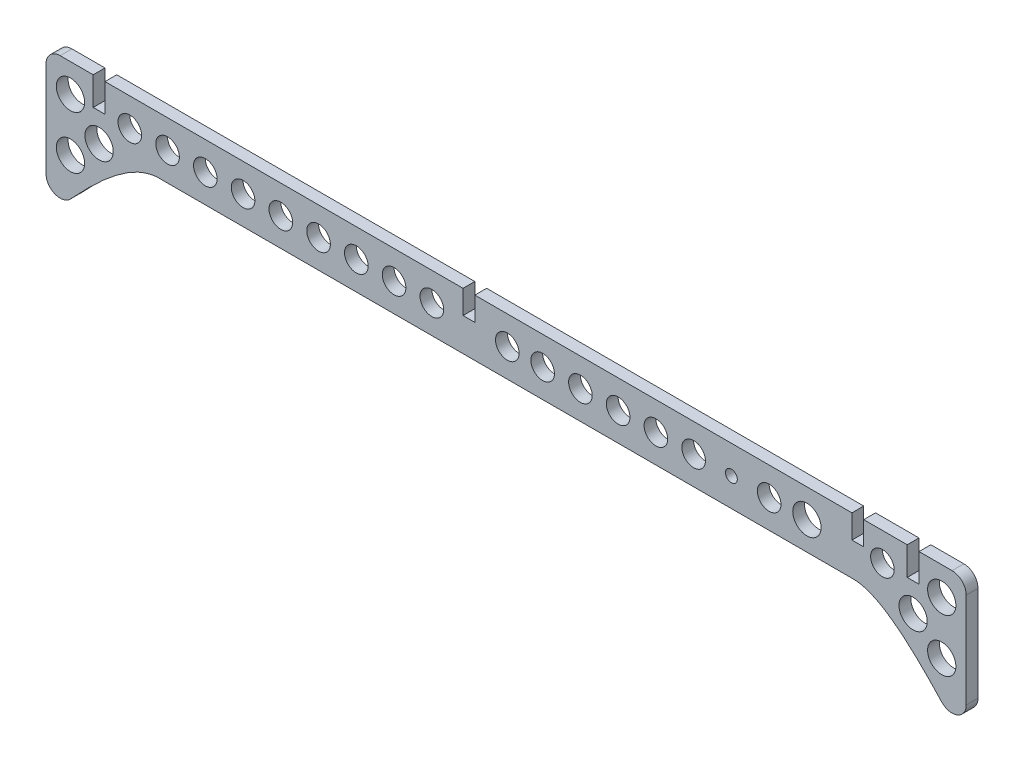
ISO-10303-21;
HEADER;
FILE_DESCRIPTION(('STEP AP214'),'2;1');
FILE_NAME('part.step','',(''),(''),'','','');
FILE_SCHEMA(('AUTOMOTIVE_DESIGN { 1 0 10303 214 1 1 1 1 }'));
ENDSEC;
DATA;
#1=APPLICATION_CONTEXT('core data for automotive mechanical design processes');
#2=APPLICATION_PROTOCOL_DEFINITION('international standard','automotive_design',2000,#1);
#3=PRODUCT_CONTEXT('',#1,'mechanical');
#4=PRODUCT('Part','Part','',(#3));
#5=PRODUCT_RELATED_PRODUCT_CATEGORY('part','',(#4));
#6=PRODUCT_DEFINITION_FORMATION('','',#4);
#7=PRODUCT_DEFINITION_CONTEXT('part definition',#1,'design');
#8=PRODUCT_DEFINITION('design','',#6,#7);
#9=PRODUCT_DEFINITION_SHAPE('','',#8);
#10=(LENGTH_UNIT() NAMED_UNIT(*) SI_UNIT(.MILLI.,.METRE.));
#11=(NAMED_UNIT(*) PLANE_ANGLE_UNIT() SI_UNIT($,.RADIAN.));
#12=(NAMED_UNIT(*) SI_UNIT($,.STERADIAN.) SOLID_ANGLE_UNIT());
#13=UNCERTAINTY_MEASURE_WITH_UNIT(LENGTH_MEASURE(1.E-05),#10,'distance_accuracy_value','');
#14=(GEOMETRIC_REPRESENTATION_CONTEXT(3) GLOBAL_UNCERTAINTY_ASSIGNED_CONTEXT((#13)) GLOBAL_UNIT_ASSIGNED_CONTEXT((#10,
#11,#12)) REPRESENTATION_CONTEXT('',''));
#15=CARTESIAN_POINT('',(0.,0.,0.));
#16=DIRECTION('',(0.,0.,1.));
#17=DIRECTION('',(1.,0.,0.));
#18=AXIS2_PLACEMENT_3D('',#15,#16,#17);
#19=CARTESIAN_POINT('',(-120.015,-21.7846997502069,3.175));
#20=DIRECTION('',(0.,0.,1.));
#21=DIRECTION('',(1.,0.,0.));
#22=AXIS2_PLACEMENT_3D('',#19,#20,#21);
#23=PLANE('',#22);
#24=CARTESIAN_POINT('',(109.5375,-7.62000000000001,3.175));
#25=DIRECTION('',(0.,0.,1.));
#26=DIRECTION('',(-1.,0.,0.));
#27=AXIS2_PLACEMENT_3D('',#24,#25,#26);
#28=CIRCLE('',#27,3.81);
#29=CARTESIAN_POINT('',(105.7275,-7.62000000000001,3.175));
#30=VERTEX_POINT('',#29);
#31=EDGE_CURVE('E554',#30,#30,#28,.T.);
#32=ORIENTED_EDGE('',*,*,#31,.F.);
#33=EDGE_LOOP('',(#32));
#34=FACE_BOUND('',#33,.T.);
#35=CARTESIAN_POINT('',(-117.239990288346,-14.2125382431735,3.175));
#36=DIRECTION('',(0.,0.,1.));
#37=DIRECTION('',(1.,0.,0.));
#38=AXIS2_PLACEMENT_3D('',#35,#36,#37);
#39=CIRCLE('',#38,3.81);
#40=CARTESIAN_POINT('',(-113.429990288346,-14.2125382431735,3.175));
#41=VERTEX_POINT('',#40);
#42=EDGE_CURVE('E542',#41,#41,#39,.T.);
#43=ORIENTED_EDGE('',*,*,#42,.F.);
#44=EDGE_LOOP('',(#43));
#45=FACE_BOUND('',#44,.T.);
#46=CARTESIAN_POINT('',(117.239990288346,0.,3.175));
#47=DIRECTION('',(0.,0.,1.));
#48=DIRECTION('',(-1.,0.,0.));
#49=AXIS2_PLACEMENT_3D('',#46,#47,#48);
#50=CIRCLE('',#49,3.81);
#51=CARTESIAN_POINT('',(113.429990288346,0.,3.175));
#52=VERTEX_POINT('',#51);
#53=EDGE_CURVE('E530',#52,#52,#50,.T.);
#54=ORIENTED_EDGE('',*,*,#53,.F.);
#55=EDGE_LOOP('',(#54));
#56=FACE_BOUND('',#55,.T.);
#57=CARTESIAN_POINT('',(80.9512876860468,0.,3.175));
#58=DIRECTION('',(0.,0.,1.));
#59=DIRECTION('',(-1.,0.,0.));
#60=AXIS2_PLACEMENT_3D('',#57,#58,#59);
#61=CIRCLE('',#60,3.81);
#62=CARTESIAN_POINT('',(77.1412876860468,0.,3.175));
#63=VERTEX_POINT('',#62);
#64=EDGE_CURVE('E518',#63,#63,#61,.T.);
#65=ORIENTED_EDGE('',*,*,#64,.F.);
#66=EDGE_LOOP('',(#65));
#67=FACE_BOUND('',#66,.T.);
#68=CARTESIAN_POINT('',(50.4712876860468,0.,3.175));
#69=DIRECTION('',(0.,0.,1.));
#70=DIRECTION('',(-1.,0.,0.));
#71=AXIS2_PLACEMENT_3D('',#68,#69,#70);
#72=CIRCLE('',#71,3.175);
#73=CARTESIAN_POINT('',(47.2962876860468,0.,3.175));
#74=VERTEX_POINT('',#73);
#75=EDGE_CURVE('E506',#74,#74,#72,.T.);
#76=ORIENTED_EDGE('',*,*,#75,.F.);
#77=EDGE_LOOP('',(#76));
#78=FACE_BOUND('',#77,.T.);
#79=CARTESIAN_POINT('',(30.1512876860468,0.,3.175));
#80=DIRECTION('',(0.,0.,1.));
#81=DIRECTION('',(-1.,0.,0.));
#82=AXIS2_PLACEMENT_3D('',#79,#80,#81);
#83=CIRCLE('',#82,3.175);
#84=CARTESIAN_POINT('',(26.9762876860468,0.,3.175));
#85=VERTEX_POINT('',#84);
#86=EDGE_CURVE('E494',#85,#85,#83,.T.);
#87=ORIENTED_EDGE('',*,*,#86,.F.);
#88=EDGE_LOOP('',(#87));
#89=FACE_BOUND('',#88,.T.);
#90=CARTESIAN_POINT('',(9.83128768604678,0.,3.175));
#91=DIRECTION('',(0.,0.,1.));
#92=DIRECTION('',(-1.,0.,0.));
#93=AXIS2_PLACEMENT_3D('',#90,#91,#92);
#94=CIRCLE('',#93,3.175);
#95=CARTESIAN_POINT('',(6.65628768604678,0.,3.175));
#96=VERTEX_POINT('',#95);
#97=EDGE_CURVE('E482',#96,#96,#94,.T.);
#98=ORIENTED_EDGE('',*,*,#97,.F.);
#99=EDGE_LOOP('',(#98));
#100=FACE_BOUND('',#99,.T.);
#101=CARTESIAN_POINT('',(-19.9912876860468,0.,3.175));
#102=DIRECTION('',(0.,0.,1.));
#103=DIRECTION('',(1.,0.,0.));
#104=AXIS2_PLACEMENT_3D('',#101,#102,#103);
#105=CIRCLE('',#104,3.175);
#106=CARTESIAN_POINT('',(-16.8162876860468,0.,3.175));
#107=VERTEX_POINT('',#106);
#108=EDGE_CURVE('E470',#107,#107,#105,.T.);
#109=ORIENTED_EDGE('',*,*,#108,.F.);
#110=EDGE_LOOP('',(#109));
#111=FACE_BOUND('',#110,.T.);
#112=CARTESIAN_POINT('',(-40.3112876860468,0.,3.175));
#113=DIRECTION('',(0.,0.,1.));
#114=DIRECTION('',(1.,0.,0.));
#115=AXIS2_PLACEMENT_3D('',#112,#113,#114);
#116=CIRCLE('',#115,3.175);
#117=CARTESIAN_POINT('',(-37.1362876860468,0.,3.175));
#118=VERTEX_POINT('',#117);
#119=EDGE_CURVE('E458',#118,#118,#116,.T.);
#120=ORIENTED_EDGE('',*,*,#119,.F.);
#121=EDGE_LOOP('',(#120));
#122=FACE_BOUND('',#121,.T.);
#123=CARTESIAN_POINT('',(-60.6312876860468,0.,3.175));
#124=DIRECTION('',(0.,0.,1.));
#125=DIRECTION('',(1.,0.,0.));
#126=AXIS2_PLACEMENT_3D('',#123,#124,#125);
#127=CIRCLE('',#126,3.175);
#128=CARTESIAN_POINT('',(-57.4562876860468,0.,3.175));
#129=VERTEX_POINT('',#128);
#130=EDGE_CURVE('E446',#129,#129,#127,.T.);
#131=ORIENTED_EDGE('',*,*,#130,.F.);
#132=EDGE_LOOP('',(#131));
#133=FACE_BOUND('',#132,.T.);
#134=CARTESIAN_POINT('',(-80.9512876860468,0.,3.175));
#135=DIRECTION('',(0.,0.,1.));
#136=DIRECTION('',(1.,0.,0.));
#137=AXIS2_PLACEMENT_3D('',#134,#135,#136);
#138=CIRCLE('',#137,3.175);
#139=CARTESIAN_POINT('',(-77.7762876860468,0.,3.175));
#140=VERTEX_POINT('',#139);
#141=EDGE_CURVE('E434',#140,#140,#138,.T.);
#142=ORIENTED_EDGE('',*,*,#141,.F.);
#143=EDGE_LOOP('',(#142));
#144=FACE_BOUND('',#143,.T.);
#145=CARTESIAN_POINT('',(-101.271287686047,0.,3.175));
#146=DIRECTION('',(0.,0.,1.));
#147=DIRECTION('',(1.,0.,0.));
#148=AXIS2_PLACEMENT_3D('',#145,#146,#147);
#149=CIRCLE('',#148,3.175);
#150=CARTESIAN_POINT('',(-98.0962876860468,0.,3.175));
#151=VERTEX_POINT('',#150);
#152=EDGE_CURVE('E422',#151,#151,#149,.T.);
#153=ORIENTED_EDGE('',*,*,#152,.F.);
#154=EDGE_LOOP('',(#153));
#155=FACE_BOUND('',#154,.T.);
#156=DIRECTION('',(0.,-1.,0.));
#157=VECTOR('',#156,1.);
#158=CARTESIAN_POINT('',(-123.825,0.,3.175));
#159=LINE('',#158,#157);
#160=CARTESIAN_POINT('',(-123.825,3.80999999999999,3.175));
#161=VERTEX_POINT('',#160);
#162=CARTESIAN_POINT('',(-123.825,-21.7846997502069,3.175));
#163=VERTEX_POINT('',#162);
#164=EDGE_CURVE('E48',#161,#163,#159,.T.);
#165=ORIENTED_EDGE('',*,*,#164,.T.);
#166=CARTESIAN_POINT('',(-120.015,-21.7846997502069,3.175));
#167=DIRECTION('',(0.,0.,1.));
#168=DIRECTION('',(1.,0.,0.));
#169=AXIS2_PLACEMENT_3D('',#166,#167,#168);
#170=CIRCLE('',#169,3.80999999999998);
#171=CARTESIAN_POINT('',(-117.239990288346,-24.3953358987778,3.175));
#172=VERTEX_POINT('',#171);
#173=EDGE_CURVE('E146',#163,#172,#170,.T.);
#174=ORIENTED_EDGE('',*,*,#173,.T.);
#175=CARTESIAN_POINT('',(-117.239990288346,-24.3953358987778,3.175));
#176=CARTESIAN_POINT('',(-110.980979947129,-17.7422392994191,3.175));
#177=CARTESIAN_POINT('',(-101.376457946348,-7.66034233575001,3.175));
#178=CARTESIAN_POINT('',(-93.469360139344,-7.62000000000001,3.175));
#179=B_SPLINE_CURVE_WITH_KNOTS('',3,(#175,#176,#177,#178),.UNSPECIFIED.,.F.,.F.,(4,4),
(0.386367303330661,1.),.UNSPECIFIED.);
#180=CARTESIAN_POINT('',(-93.469360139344,-7.62000000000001,3.175));
#181=VERTEX_POINT('',#180);
#182=EDGE_CURVE('E369',#172,#181,#179,.T.);
#183=ORIENTED_EDGE('',*,*,#182,.T.);
#184=DIRECTION('',(1.,0.,0.));
#185=VECTOR('',#184,1.);
#186=CARTESIAN_POINT('',(93.469360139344,-7.62000000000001,3.175));
#187=LINE('',#186,#185);
#188=CARTESIAN_POINT('',(93.469360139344,-7.61999999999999,3.175));
#189=VERTEX_POINT('',#188);
#190=EDGE_CURVE('E389',#181,#189,#187,.T.);
#191=ORIENTED_EDGE('',*,*,#190,.T.);
#192=CARTESIAN_POINT('',(93.469360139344,-7.61999999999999,3.175));
#193=CARTESIAN_POINT('',(101.376457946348,-7.66034233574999,3.175));
#194=CARTESIAN_POINT('',(110.980979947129,-17.742239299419,3.175));
#195=CARTESIAN_POINT('',(117.239990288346,-24.3953358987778,3.175));
#196=B_SPLINE_CURVE_WITH_KNOTS('',3,(#192,#193,#194,#195),.UNSPECIFIED.,.F.,.F.,(4,4),
(0.386367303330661,1.),.UNSPECIFIED.);
#197=CARTESIAN_POINT('',(117.239990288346,-24.3953358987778,3.175));
#198=VERTEX_POINT('',#197);
#199=EDGE_CURVE('E386',#189,#198,#196,.T.);
#200=ORIENTED_EDGE('',*,*,#199,.T.);
#201=CARTESIAN_POINT('',(120.015,-21.7846997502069,3.175));
#202=DIRECTION('',(0.,0.,1.));
#203=DIRECTION('',(-1.,0.,0.));
#204=AXIS2_PLACEMENT_3D('',#201,#202,#203);
#205=CIRCLE('',#204,3.80999999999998);
#206=CARTESIAN_POINT('',(123.825,-21.7846997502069,3.175));
#207=VERTEX_POINT('',#206);
#208=EDGE_CURVE('E388',#198,#207,#205,.T.);
#209=ORIENTED_EDGE('',*,*,#208,.T.);
#210=DIRECTION('',(0.,1.,0.));
#211=VECTOR('',#210,1.);
#212=CARTESIAN_POINT('',(123.825,0.,3.175));
#213=LINE('',#212,#211);
#214=CARTESIAN_POINT('',(123.825,3.80999999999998,3.175));
#215=VERTEX_POINT('',#214);
#216=EDGE_CURVE('E391',#207,#215,#213,.T.);
#217=ORIENTED_EDGE('',*,*,#216,.T.);
#218=CARTESIAN_POINT('',(120.015,3.80999999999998,3.175));
#219=DIRECTION('',(0.,0.,1.));
#220=DIRECTION('',(1.,0.,0.));
#221=AXIS2_PLACEMENT_3D('',#218,#219,#220);
#222=CIRCLE('',#221,3.81);
#223=CARTESIAN_POINT('',(120.015,7.61999999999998,3.175));
#224=VERTEX_POINT('',#223);
#225=EDGE_CURVE('E672',#215,#224,#222,.T.);
#226=ORIENTED_EDGE('',*,*,#225,.T.);
#227=DIRECTION('',(-1.,0.,0.));
#228=VECTOR('',#227,1.);
#229=CARTESIAN_POINT('',(111.125,7.61999999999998,3.175));
#230=LINE('',#229,#228);
#231=CARTESIAN_POINT('',(111.125,7.61999999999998,3.175));
#232=VERTEX_POINT('',#231);
#233=EDGE_CURVE('E683',#224,#232,#230,.T.);
#234=ORIENTED_EDGE('',*,*,#233,.T.);
#235=DIRECTION('',(0.,-1.,0.));
#236=VECTOR('',#235,1.);
#237=CARTESIAN_POINT('',(111.125,7.61999999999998,3.175));
#238=LINE('',#237,#236);
#239=CARTESIAN_POINT('',(111.125,0.,3.175));
#240=VERTEX_POINT('',#239);
#241=EDGE_CURVE('E680',#232,#240,#238,.T.);
#242=ORIENTED_EDGE('',*,*,#241,.T.);
#243=DIRECTION('',(-1.,0.,0.));
#244=VECTOR('',#243,1.);
#245=CARTESIAN_POINT('',(107.95,0.,3.175));
#246=LINE('',#245,#244);
#247=CARTESIAN_POINT('',(107.95,0.,3.175));
#248=VERTEX_POINT('',#247);
#249=EDGE_CURVE('E682',#240,#248,#246,.T.);
#250=ORIENTED_EDGE('',*,*,#249,.T.);
#251=DIRECTION('',(0.,1.,0.));
#252=VECTOR('',#251,1.);
#253=CARTESIAN_POINT('',(107.95,7.61999999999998,3.175));
#254=LINE('',#253,#252);
#255=CARTESIAN_POINT('',(107.95,7.61999999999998,3.175));
#256=VERTEX_POINT('',#255);
#257=EDGE_CURVE('E685',#248,#256,#254,.T.);
#258=ORIENTED_EDGE('',*,*,#257,.T.);
#259=DIRECTION('',(-1.,0.,0.));
#260=VECTOR('',#259,1.);
#261=CARTESIAN_POINT('',(107.95,7.61999999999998,3.175));
#262=LINE('',#261,#260);
#263=CARTESIAN_POINT('',(96.2480587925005,7.62000000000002,3.175));
#264=VERTEX_POINT('',#263);
#265=EDGE_CURVE('E691',#256,#264,#262,.T.);
#266=ORIENTED_EDGE('',*,*,#265,.T.);
#267=DIRECTION('',(0.,-1.,0.));
#268=VECTOR('',#267,1.);
#269=CARTESIAN_POINT('',(96.2480587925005,1.27000000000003,3.175));
#270=LINE('',#269,#268);
#271=CARTESIAN_POINT('',(96.2480587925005,1.27000000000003,3.175));
#272=VERTEX_POINT('',#271);
#273=EDGE_CURVE('E693',#264,#272,#270,.T.);
#274=ORIENTED_EDGE('',*,*,#273,.T.);
#275=DIRECTION('',(-1.,0.,0.));
#276=VECTOR('',#275,1.);
#277=CARTESIAN_POINT('',(93.0730587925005,1.27000000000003,3.175));
#278=LINE('',#277,#276);
#279=CARTESIAN_POINT('',(93.0730587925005,1.27000000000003,3.175));
#280=VERTEX_POINT('',#279);
#281=EDGE_CURVE('E695',#272,#280,#278,.T.);
#282=ORIENTED_EDGE('',*,*,#281,.T.);
#283=DIRECTION('',(0.,1.,0.));
#284=VECTOR('',#283,1.);
#285=CARTESIAN_POINT('',(93.0730587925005,7.62000000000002,3.175));
#286=LINE('',#285,#284);
#287=CARTESIAN_POINT('',(93.0730587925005,7.62000000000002,3.175));
#288=VERTEX_POINT('',#287);
#289=EDGE_CURVE('E697',#280,#288,#286,.T.);
#290=ORIENTED_EDGE('',*,*,#289,.T.);
#291=DIRECTION('',(-1.,0.,0.));
#292=VECTOR('',#291,1.);
#293=CARTESIAN_POINT('',(93.0730587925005,7.62000000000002,3.175));
#294=LINE('',#293,#292);
#295=CARTESIAN_POINT('',(-8.41485879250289,7.62000000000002,3.175));
#296=VERTEX_POINT('',#295);
#297=EDGE_CURVE('E699',#288,#296,#294,.T.);
#298=ORIENTED_EDGE('',*,*,#297,.T.);
#299=DIRECTION('',(0.,-1.,0.));
#300=VECTOR('',#299,1.);
#301=CARTESIAN_POINT('',(-8.41485879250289,1.27000000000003,3.175));
#302=LINE('',#301,#300);
#303=CARTESIAN_POINT('',(-8.41485879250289,1.27000000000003,3.175));
#304=VERTEX_POINT('',#303);
#305=EDGE_CURVE('E701',#296,#304,#302,.T.);
#306=ORIENTED_EDGE('',*,*,#305,.T.);
#307=DIRECTION('',(-1.,0.,0.));
#308=VECTOR('',#307,1.);
#309=CARTESIAN_POINT('',(-11.5898587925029,1.27000000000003,3.175));
#310=LINE('',#309,#308);
#311=CARTESIAN_POINT('',(-11.5898587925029,1.27000000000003,3.175));
#312=VERTEX_POINT('',#311);
#313=EDGE_CURVE('E703',#304,#312,#310,.T.);
#314=ORIENTED_EDGE('',*,*,#313,.T.);
#315=DIRECTION('',(0.,1.,0.));
#316=VECTOR('',#315,1.);
#317=CARTESIAN_POINT('',(-11.5898587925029,7.62000000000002,3.175));
#318=LINE('',#317,#316);
#319=CARTESIAN_POINT('',(-11.5898587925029,7.62000000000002,3.175));
#320=VERTEX_POINT('',#319);
#321=EDGE_CURVE('E705',#312,#320,#318,.T.);
#322=ORIENTED_EDGE('',*,*,#321,.T.);
#323=DIRECTION('',(-1.,0.,0.));
#324=VECTOR('',#323,1.);
#325=CARTESIAN_POINT('',(-11.5898587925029,7.62000000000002,3.175));
#326=LINE('',#325,#324);
#327=CARTESIAN_POINT('',(-107.95,7.61999999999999,3.175));
#328=VERTEX_POINT('',#327);
#329=EDGE_CURVE('E707',#320,#328,#326,.T.);
#330=ORIENTED_EDGE('',*,*,#329,.T.);
#331=DIRECTION('',(0.,-1.,0.));
#332=VECTOR('',#331,1.);
#333=CARTESIAN_POINT('',(-107.95,7.61999999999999,3.175));
#334=LINE('',#333,#332);
#335=CARTESIAN_POINT('',(-107.95,0.,3.175));
#336=VERTEX_POINT('',#335);
#337=EDGE_CURVE('E709',#328,#336,#334,.T.);
#338=ORIENTED_EDGE('',*,*,#337,.T.);
#339=DIRECTION('',(-1.,0.,0.));
#340=VECTOR('',#339,1.);
#341=CARTESIAN_POINT('',(-107.95,0.,3.175));
#342=LINE('',#341,#340);
#343=CARTESIAN_POINT('',(-111.125,0.,3.175));
#344=VERTEX_POINT('',#343);
#345=EDGE_CURVE('E220',#336,#344,#342,.T.);
#346=ORIENTED_EDGE('',*,*,#345,.T.);
#347=DIRECTION('',(0.,1.,0.));
#348=VECTOR('',#347,1.);
#349=CARTESIAN_POINT('',(-111.125,7.61999999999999,3.175));
#350=LINE('',#349,#348);
#351=CARTESIAN_POINT('',(-111.125,7.61999999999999,3.175));
#352=VERTEX_POINT('',#351);
#353=EDGE_CURVE('E214',#344,#352,#350,.T.);
#354=ORIENTED_EDGE('',*,*,#353,.T.);
#355=DIRECTION('',(-1.,0.,0.));
#356=VECTOR('',#355,1.);
#357=CARTESIAN_POINT('',(-111.125,7.61999999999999,3.175));
#358=LINE('',#357,#356);
#359=CARTESIAN_POINT('',(-120.015,7.61999999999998,3.175));
#360=VERTEX_POINT('',#359);
#361=EDGE_CURVE('E218',#352,#360,#358,.T.);
#362=ORIENTED_EDGE('',*,*,#361,.T.);
#363=CARTESIAN_POINT('',(-120.015,3.80999999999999,3.175));
#364=DIRECTION('',(0.,0.,1.));
#365=DIRECTION('',(-1.,0.,0.));
#366=AXIS2_PLACEMENT_3D('',#363,#364,#365);
#367=CIRCLE('',#366,3.81);
#368=EDGE_CURVE('E234',#360,#161,#367,.T.);
#369=ORIENTED_EDGE('',*,*,#368,.T.);
#370=EDGE_LOOP('',(#165,#174,#183,#191,#200,#209,#217,#226,#234,#242,#250,#258,#266,#274,#282,
#290,#298,#306,#314,#322,#330,#338,#346,#354,#362,#369));
#371=FACE_BOUND('',#370,.T.);
#372=CARTESIAN_POINT('',(-117.239990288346,0.,3.175));
#373=DIRECTION('',(0.,0.,1.));
#374=DIRECTION('',(1.,0.,0.));
#375=AXIS2_PLACEMENT_3D('',#372,#373,#374);
#376=CIRCLE('',#375,3.81);
#377=CARTESIAN_POINT('',(-113.429990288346,0.,3.175));
#378=VERTEX_POINT('',#377);
#379=EDGE_CURVE('E243',#378,#378,#376,.T.);
#380=ORIENTED_EDGE('',*,*,#379,.F.);
#381=EDGE_LOOP('',(#380));
#382=FACE_BOUND('',#381,.T.);
#383=CARTESIAN_POINT('',(-91.1112876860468,0.,3.175));
#384=DIRECTION('',(0.,0.,1.));
#385=DIRECTION('',(1.,0.,0.));
#386=AXIS2_PLACEMENT_3D('',#383,#384,#385);
#387=CIRCLE('',#386,3.175);
#388=CARTESIAN_POINT('',(-87.9362876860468,0.,3.175));
#389=VERTEX_POINT('',#388);
#390=EDGE_CURVE('E428',#389,#389,#387,.T.);
#391=ORIENTED_EDGE('',*,*,#390,.F.);
#392=EDGE_LOOP('',(#391));
#393=FACE_BOUND('',#392,.T.);
#394=CARTESIAN_POINT('',(-70.7912876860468,0.,3.175));
#395=DIRECTION('',(0.,0.,1.));
#396=DIRECTION('',(1.,0.,0.));
#397=AXIS2_PLACEMENT_3D('',#394,#395,#396);
#398=CIRCLE('',#397,3.175);
#399=CARTESIAN_POINT('',(-67.6162876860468,0.,3.175));
#400=VERTEX_POINT('',#399);
#401=EDGE_CURVE('E440',#400,#400,#398,.T.);
#402=ORIENTED_EDGE('',*,*,#401,.F.);
#403=EDGE_LOOP('',(#402));
#404=FACE_BOUND('',#403,.T.);
#405=CARTESIAN_POINT('',(-50.4712876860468,0.,3.175));
#406=DIRECTION('',(0.,0.,1.));
#407=DIRECTION('',(1.,0.,0.));
#408=AXIS2_PLACEMENT_3D('',#405,#406,#407);
#409=CIRCLE('',#408,3.175);
#410=CARTESIAN_POINT('',(-47.2962876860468,0.,3.175));
#411=VERTEX_POINT('',#410);
#412=EDGE_CURVE('E452',#411,#411,#409,.T.);
#413=ORIENTED_EDGE('',*,*,#412,.F.);
#414=EDGE_LOOP('',(#413));
#415=FACE_BOUND('',#414,.T.);
#416=CARTESIAN_POINT('',(-30.1512876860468,0.,3.175));
#417=DIRECTION('',(0.,0.,1.));
#418=DIRECTION('',(1.,0.,0.));
#419=AXIS2_PLACEMENT_3D('',#416,#417,#418);
#420=CIRCLE('',#419,3.175);
#421=CARTESIAN_POINT('',(-26.9762876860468,0.,3.175));
#422=VERTEX_POINT('',#421);
#423=EDGE_CURVE('E464',#422,#422,#420,.T.);
#424=ORIENTED_EDGE('',*,*,#423,.F.);
#425=EDGE_LOOP('',(#424));
#426=FACE_BOUND('',#425,.T.);
#427=CARTESIAN_POINT('',(0.328712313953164,0.,3.175));
#428=DIRECTION('',(0.,0.,1.));
#429=DIRECTION('',(1.,0.,0.));
#430=AXIS2_PLACEMENT_3D('',#427,#428,#429);
#431=CIRCLE('',#430,3.175);
#432=CARTESIAN_POINT('',(3.50371231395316,0.,3.175));
#433=VERTEX_POINT('',#432);
#434=EDGE_CURVE('E476',#433,#433,#431,.T.);
#435=ORIENTED_EDGE('',*,*,#434,.F.);
#436=EDGE_LOOP('',(#435));
#437=FACE_BOUND('',#436,.T.);
#438=CARTESIAN_POINT('',(19.9912876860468,0.,3.175));
#439=DIRECTION('',(0.,0.,1.));
#440=DIRECTION('',(-1.,0.,0.));
#441=AXIS2_PLACEMENT_3D('',#438,#439,#440);
#442=CIRCLE('',#441,3.175);
#443=CARTESIAN_POINT('',(16.8162876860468,0.,3.175));
#444=VERTEX_POINT('',#443);
#445=EDGE_CURVE('E488',#444,#444,#442,.T.);
#446=ORIENTED_EDGE('',*,*,#445,.F.);
#447=EDGE_LOOP('',(#446));
#448=FACE_BOUND('',#447,.T.);
#449=CARTESIAN_POINT('',(40.3112876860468,0.,3.175));
#450=DIRECTION('',(0.,0.,1.));
#451=DIRECTION('',(-1.,0.,0.));
#452=AXIS2_PLACEMENT_3D('',#449,#450,#451);
#453=CIRCLE('',#452,3.175);
#454=CARTESIAN_POINT('',(37.1362876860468,0.,3.175));
#455=VERTEX_POINT('',#454);
#456=EDGE_CURVE('E500',#455,#455,#453,.T.);
#457=ORIENTED_EDGE('',*,*,#456,.F.);
#458=EDGE_LOOP('',(#457));
#459=FACE_BOUND('',#458,.T.);
#460=CARTESIAN_POINT('',(70.7912876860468,0.,3.175));
#461=DIRECTION('',(0.,0.,1.));
#462=DIRECTION('',(-1.,0.,0.));
#463=AXIS2_PLACEMENT_3D('',#460,#461,#462);
#464=CIRCLE('',#463,3.175);
#465=CARTESIAN_POINT('',(67.6162876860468,0.,3.175));
#466=VERTEX_POINT('',#465);
#467=EDGE_CURVE('E512',#466,#466,#464,.T.);
#468=ORIENTED_EDGE('',*,*,#467,.F.);
#469=EDGE_LOOP('',(#468));
#470=FACE_BOUND('',#469,.T.);
#471=CARTESIAN_POINT('',(101.271287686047,0.,3.175));
#472=DIRECTION('',(0.,0.,1.));
#473=DIRECTION('',(-1.,0.,0.));
#474=AXIS2_PLACEMENT_3D('',#471,#472,#473);
#475=CIRCLE('',#474,3.175);
#476=CARTESIAN_POINT('',(98.0962876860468,0.,3.175));
#477=VERTEX_POINT('',#476);
#478=EDGE_CURVE('E524',#477,#477,#475,.T.);
#479=ORIENTED_EDGE('',*,*,#478,.F.);
#480=EDGE_LOOP('',(#479));
#481=FACE_BOUND('',#480,.T.);
#482=CARTESIAN_POINT('',(-109.5375,-7.62000000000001,3.175));
#483=DIRECTION('',(0.,0.,1.));
#484=DIRECTION('',(1.,0.,0.));
#485=AXIS2_PLACEMENT_3D('',#482,#483,#484);
#486=CIRCLE('',#485,3.81);
#487=CARTESIAN_POINT('',(-105.7275,-7.62000000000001,3.175));
#488=VERTEX_POINT('',#487);
#489=EDGE_CURVE('E536',#488,#488,#486,.T.);
#490=ORIENTED_EDGE('',*,*,#489,.F.);
#491=EDGE_LOOP('',(#490));
#492=FACE_BOUND('',#491,.T.);
#493=CARTESIAN_POINT('',(117.239990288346,-14.2125382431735,3.175));
#494=DIRECTION('',(0.,0.,1.));
#495=DIRECTION('',(-1.,0.,0.));
#496=AXIS2_PLACEMENT_3D('',#493,#494,#495);
#497=CIRCLE('',#496,3.81);
#498=CARTESIAN_POINT('',(113.429990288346,-14.2125382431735,3.175));
#499=VERTEX_POINT('',#498);
#500=EDGE_CURVE('E548',#499,#499,#497,.T.);
#501=ORIENTED_EDGE('',*,*,#500,.F.);
#502=EDGE_LOOP('',(#501));
#503=FACE_BOUND('',#502,.T.);
#504=CARTESIAN_POINT('',(60.6312876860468,0.,3.175));
#505=DIRECTION('',(0.,0.,1.));
#506=DIRECTION('',(1.,0.,0.));
#507=AXIS2_PLACEMENT_3D('',#504,#505,#506);
#508=CIRCLE('',#507,1.5875);
#509=CARTESIAN_POINT('',(62.2187876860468,0.,3.175));
#510=VERTEX_POINT('',#509);
#511=EDGE_CURVE('E560',#510,#510,#508,.T.);
#512=ORIENTED_EDGE('',*,*,#511,.F.);
#513=EDGE_LOOP('',(#512));
#514=FACE_BOUND('',#513,.T.);
#515=ADVANCED_FACE('F31',(#34,#45,#56,#67,#78,#89,#100,#111,#122,#133,#144,#155,#371,#382,#393,
#404,#415,#426,#437,#448,#459,#470,#481,#492,#503,#514),#23,.T.);
#516=CARTESIAN_POINT('',(-120.015,-21.7846997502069,0.));
#517=DIRECTION('',(0.,0.,1.));
#518=DIRECTION('',(1.,0.,0.));
#519=AXIS2_PLACEMENT_3D('',#516,#517,#518);
#520=PLANE('',#519);
#521=CARTESIAN_POINT('',(109.5375,-7.62000000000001,0.));
#522=DIRECTION('',(0.,0.,1.));
#523=DIRECTION('',(-1.,0.,0.));
#524=AXIS2_PLACEMENT_3D('',#521,#522,#523);
#525=CIRCLE('',#524,3.81);
#526=CARTESIAN_POINT('',(105.7275,-7.62000000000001,0.));
#527=VERTEX_POINT('',#526);
#528=EDGE_CURVE('E557',#527,#527,#525,.T.);
#529=ORIENTED_EDGE('',*,*,#528,.T.);
#530=EDGE_LOOP('',(#529));
#531=FACE_BOUND('',#530,.T.);
#532=CARTESIAN_POINT('',(-117.239990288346,-14.2125382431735,0.));
#533=DIRECTION('',(0.,0.,1.));
#534=DIRECTION('',(1.,0.,0.));
#535=AXIS2_PLACEMENT_3D('',#532,#533,#534);
#536=CIRCLE('',#535,3.81);
#537=CARTESIAN_POINT('',(-113.429990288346,-14.2125382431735,0.));
#538=VERTEX_POINT('',#537);
#539=EDGE_CURVE('E545',#538,#538,#536,.T.);
#540=ORIENTED_EDGE('',*,*,#539,.T.);
#541=EDGE_LOOP('',(#540));
#542=FACE_BOUND('',#541,.T.);
#543=CARTESIAN_POINT('',(117.239990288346,0.,0.));
#544=DIRECTION('',(0.,0.,1.));
#545=DIRECTION('',(-1.,0.,0.));
#546=AXIS2_PLACEMENT_3D('',#543,#544,#545);
#547=CIRCLE('',#546,3.81);
#548=CARTESIAN_POINT('',(113.429990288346,0.,0.));
#549=VERTEX_POINT('',#548);
#550=EDGE_CURVE('E533',#549,#549,#547,.T.);
#551=ORIENTED_EDGE('',*,*,#550,.T.);
#552=EDGE_LOOP('',(#551));
#553=FACE_BOUND('',#552,.T.);
#554=CARTESIAN_POINT('',(80.9512876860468,0.,0.));
#555=DIRECTION('',(0.,0.,1.));
#556=DIRECTION('',(-1.,0.,0.));
#557=AXIS2_PLACEMENT_3D('',#554,#555,#556);
#558=CIRCLE('',#557,3.81);
#559=CARTESIAN_POINT('',(77.1412876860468,0.,0.));
#560=VERTEX_POINT('',#559);
#561=EDGE_CURVE('E521',#560,#560,#558,.T.);
#562=ORIENTED_EDGE('',*,*,#561,.T.);
#563=EDGE_LOOP('',(#562));
#564=FACE_BOUND('',#563,.T.);
#565=CARTESIAN_POINT('',(50.4712876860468,0.,0.));
#566=DIRECTION('',(0.,0.,1.));
#567=DIRECTION('',(-1.,0.,0.));
#568=AXIS2_PLACEMENT_3D('',#565,#566,#567);
#569=CIRCLE('',#568,3.175);
#570=CARTESIAN_POINT('',(47.2962876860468,0.,0.));
#571=VERTEX_POINT('',#570);
#572=EDGE_CURVE('E509',#571,#571,#569,.T.);
#573=ORIENTED_EDGE('',*,*,#572,.T.);
#574=EDGE_LOOP('',(#573));
#575=FACE_BOUND('',#574,.T.);
#576=CARTESIAN_POINT('',(30.1512876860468,0.,0.));
#577=DIRECTION('',(0.,0.,1.));
#578=DIRECTION('',(-1.,0.,0.));
#579=AXIS2_PLACEMENT_3D('',#576,#577,#578);
#580=CIRCLE('',#579,3.175);
#581=CARTESIAN_POINT('',(26.9762876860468,0.,0.));
#582=VERTEX_POINT('',#581);
#583=EDGE_CURVE('E497',#582,#582,#580,.T.);
#584=ORIENTED_EDGE('',*,*,#583,.T.);
#585=EDGE_LOOP('',(#584));
#586=FACE_BOUND('',#585,.T.);
#587=CARTESIAN_POINT('',(9.83128768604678,0.,0.));
#588=DIRECTION('',(0.,0.,1.));
#589=DIRECTION('',(-1.,0.,0.));
#590=AXIS2_PLACEMENT_3D('',#587,#588,#589);
#591=CIRCLE('',#590,3.175);
#592=CARTESIAN_POINT('',(6.65628768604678,0.,0.));
#593=VERTEX_POINT('',#592);
#594=EDGE_CURVE('E485',#593,#593,#591,.T.);
#595=ORIENTED_EDGE('',*,*,#594,.T.);
#596=EDGE_LOOP('',(#595));
#597=FACE_BOUND('',#596,.T.);
#598=CARTESIAN_POINT('',(-19.9912876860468,0.,0.));
#599=DIRECTION('',(0.,0.,1.));
#600=DIRECTION('',(1.,0.,0.));
#601=AXIS2_PLACEMENT_3D('',#598,#599,#600);
#602=CIRCLE('',#601,3.175);
#603=CARTESIAN_POINT('',(-16.8162876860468,0.,0.));
#604=VERTEX_POINT('',#603);
#605=EDGE_CURVE('E473',#604,#604,#602,.T.);
#606=ORIENTED_EDGE('',*,*,#605,.T.);
#607=EDGE_LOOP('',(#606));
#608=FACE_BOUND('',#607,.T.);
#609=CARTESIAN_POINT('',(-40.3112876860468,0.,0.));
#610=DIRECTION('',(0.,0.,1.));
#611=DIRECTION('',(1.,0.,0.));
#612=AXIS2_PLACEMENT_3D('',#609,#610,#611);
#613=CIRCLE('',#612,3.175);
#614=CARTESIAN_POINT('',(-37.1362876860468,0.,0.));
#615=VERTEX_POINT('',#614);
#616=EDGE_CURVE('E461',#615,#615,#613,.T.);
#617=ORIENTED_EDGE('',*,*,#616,.T.);
#618=EDGE_LOOP('',(#617));
#619=FACE_BOUND('',#618,.T.);
#620=CARTESIAN_POINT('',(-60.6312876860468,0.,0.));
#621=DIRECTION('',(0.,0.,1.));
#622=DIRECTION('',(1.,0.,0.));
#623=AXIS2_PLACEMENT_3D('',#620,#621,#622);
#624=CIRCLE('',#623,3.175);
#625=CARTESIAN_POINT('',(-57.4562876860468,0.,0.));
#626=VERTEX_POINT('',#625);
#627=EDGE_CURVE('E449',#626,#626,#624,.T.);
#628=ORIENTED_EDGE('',*,*,#627,.T.);
#629=EDGE_LOOP('',(#628));
#630=FACE_BOUND('',#629,.T.);
#631=CARTESIAN_POINT('',(-80.9512876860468,0.,0.));
#632=DIRECTION('',(0.,0.,1.));
#633=DIRECTION('',(1.,0.,0.));
#634=AXIS2_PLACEMENT_3D('',#631,#632,#633);
#635=CIRCLE('',#634,3.175);
#636=CARTESIAN_POINT('',(-77.7762876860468,0.,0.));
#637=VERTEX_POINT('',#636);
#638=EDGE_CURVE('E437',#637,#637,#635,.T.);
#639=ORIENTED_EDGE('',*,*,#638,.T.);
#640=EDGE_LOOP('',(#639));
#641=FACE_BOUND('',#640,.T.);
#642=CARTESIAN_POINT('',(-101.271287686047,0.,0.));
#643=DIRECTION('',(0.,0.,1.));
#644=DIRECTION('',(1.,0.,0.));
#645=AXIS2_PLACEMENT_3D('',#642,#643,#644);
#646=CIRCLE('',#645,3.175);
#647=CARTESIAN_POINT('',(-98.0962876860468,0.,0.));
#648=VERTEX_POINT('',#647);
#649=EDGE_CURVE('E425',#648,#648,#646,.T.);
#650=ORIENTED_EDGE('',*,*,#649,.T.);
#651=EDGE_LOOP('',(#650));
#652=FACE_BOUND('',#651,.T.);
#653=CARTESIAN_POINT('',(-120.015,-21.7846997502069,0.));
#654=DIRECTION('',(0.,0.,1.));
#655=DIRECTION('',(1.,0.,0.));
#656=AXIS2_PLACEMENT_3D('',#653,#654,#655);
#657=CIRCLE('',#656,3.80999999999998);
#658=CARTESIAN_POINT('',(-123.825,-21.7846997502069,0.));
#659=VERTEX_POINT('',#658);
#660=CARTESIAN_POINT('',(-117.239990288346,-24.3953358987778,0.));
#661=VERTEX_POINT('',#660);
#662=EDGE_CURVE('E240',#659,#661,#657,.T.);
#663=ORIENTED_EDGE('',*,*,#662,.F.);
#664=DIRECTION('',(0.,-1.,0.));
#665=VECTOR('',#664,1.);
#666=CARTESIAN_POINT('',(-123.825,0.,0.));
#667=LINE('',#666,#665);
#668=CARTESIAN_POINT('',(-123.825,3.80999999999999,0.));
#669=VERTEX_POINT('',#668);
#670=EDGE_CURVE('E299',#669,#659,#667,.T.);
#671=ORIENTED_EDGE('',*,*,#670,.F.);
#672=CARTESIAN_POINT('',(-120.015,3.80999999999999,0.));
#673=DIRECTION('',(0.,0.,1.));
#674=DIRECTION('',(-1.,0.,0.));
#675=AXIS2_PLACEMENT_3D('',#672,#673,#674);
#676=CIRCLE('',#675,3.81);
#677=CARTESIAN_POINT('',(-120.015,7.61999999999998,0.));
#678=VERTEX_POINT('',#677);
#679=EDGE_CURVE('E139',#678,#669,#676,.T.);
#680=ORIENTED_EDGE('',*,*,#679,.F.);
#681=DIRECTION('',(-1.,0.,0.));
#682=VECTOR('',#681,1.);
#683=CARTESIAN_POINT('',(-111.125,7.61999999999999,0.));
#684=LINE('',#683,#682);
#685=CARTESIAN_POINT('',(-111.125,7.61999999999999,0.));
#686=VERTEX_POINT('',#685);
#687=EDGE_CURVE('E132',#686,#678,#684,.T.);
#688=ORIENTED_EDGE('',*,*,#687,.F.);
#689=DIRECTION('',(0.,1.,0.));
#690=VECTOR('',#689,1.);
#691=CARTESIAN_POINT('',(-111.125,7.61999999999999,0.));
#692=LINE('',#691,#690);
#693=CARTESIAN_POINT('',(-111.125,0.,0.));
#694=VERTEX_POINT('',#693);
#695=EDGE_CURVE('E228',#694,#686,#692,.T.);
#696=ORIENTED_EDGE('',*,*,#695,.F.);
#697=DIRECTION('',(-1.,0.,0.));
#698=VECTOR('',#697,1.);
#699=CARTESIAN_POINT('',(-107.95,0.,0.));
#700=LINE('',#699,#698);
#701=CARTESIAN_POINT('',(-107.95,0.,0.));
#702=VERTEX_POINT('',#701);
#703=EDGE_CURVE('E294',#702,#694,#700,.T.);
#704=ORIENTED_EDGE('',*,*,#703,.F.);
#705=DIRECTION('',(0.,-1.,0.));
#706=VECTOR('',#705,1.);
#707=CARTESIAN_POINT('',(-107.95,7.61999999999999,0.));
#708=LINE('',#707,#706);
#709=CARTESIAN_POINT('',(-107.95,7.61999999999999,0.));
#710=VERTEX_POINT('',#709);
#711=EDGE_CURVE('E292',#710,#702,#708,.T.);
#712=ORIENTED_EDGE('',*,*,#711,.F.);
#713=DIRECTION('',(-1.,0.,0.));
#714=VECTOR('',#713,1.);
#715=CARTESIAN_POINT('',(-11.5898587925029,7.62000000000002,0.));
#716=LINE('',#715,#714);
#717=CARTESIAN_POINT('',(-11.5898587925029,7.62000000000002,0.));
#718=VERTEX_POINT('',#717);
#719=EDGE_CURVE('E290',#718,#710,#716,.T.);
#720=ORIENTED_EDGE('',*,*,#719,.F.);
#721=DIRECTION('',(0.,1.,0.));
#722=VECTOR('',#721,1.);
#723=CARTESIAN_POINT('',(-11.5898587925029,7.62000000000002,0.));
#724=LINE('',#723,#722);
#725=CARTESIAN_POINT('',(-11.5898587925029,1.27000000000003,0.));
#726=VERTEX_POINT('',#725);
#727=EDGE_CURVE('E288',#726,#718,#724,.T.);
#728=ORIENTED_EDGE('',*,*,#727,.F.);
#729=DIRECTION('',(-1.,0.,0.));
#730=VECTOR('',#729,1.);
#731=CARTESIAN_POINT('',(-11.5898587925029,1.27000000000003,0.));
#732=LINE('',#731,#730);
#733=CARTESIAN_POINT('',(-8.41485879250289,1.27000000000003,0.));
#734=VERTEX_POINT('',#733);
#735=EDGE_CURVE('E286',#734,#726,#732,.T.);
#736=ORIENTED_EDGE('',*,*,#735,.F.);
#737=DIRECTION('',(0.,-1.,0.));
#738=VECTOR('',#737,1.);
#739=CARTESIAN_POINT('',(-8.41485879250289,1.27000000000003,0.));
#740=LINE('',#739,#738);
#741=CARTESIAN_POINT('',(-8.41485879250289,7.62000000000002,0.));
#742=VERTEX_POINT('',#741);
#743=EDGE_CURVE('E284',#742,#734,#740,.T.);
#744=ORIENTED_EDGE('',*,*,#743,.F.);
#745=DIRECTION('',(-1.,0.,0.));
#746=VECTOR('',#745,1.);
#747=CARTESIAN_POINT('',(93.0730587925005,7.62000000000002,0.));
#748=LINE('',#747,#746);
#749=CARTESIAN_POINT('',(93.0730587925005,7.62000000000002,0.));
#750=VERTEX_POINT('',#749);
#751=EDGE_CURVE('E282',#750,#742,#748,.T.);
#752=ORIENTED_EDGE('',*,*,#751,.F.);
#753=DIRECTION('',(0.,1.,0.));
#754=VECTOR('',#753,1.);
#755=CARTESIAN_POINT('',(93.0730587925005,7.62000000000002,0.));
#756=LINE('',#755,#754);
#757=CARTESIAN_POINT('',(93.0730587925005,1.27000000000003,0.));
#758=VERTEX_POINT('',#757);
#759=EDGE_CURVE('E280',#758,#750,#756,.T.);
#760=ORIENTED_EDGE('',*,*,#759,.F.);
#761=DIRECTION('',(-1.,0.,0.));
#762=VECTOR('',#761,1.);
#763=CARTESIAN_POINT('',(93.0730587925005,1.27000000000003,0.));
#764=LINE('',#763,#762);
#765=CARTESIAN_POINT('',(96.2480587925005,1.27000000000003,0.));
#766=VERTEX_POINT('',#765);
#767=EDGE_CURVE('E278',#766,#758,#764,.T.);
#768=ORIENTED_EDGE('',*,*,#767,.F.);
#769=DIRECTION('',(0.,-1.,0.));
#770=VECTOR('',#769,1.);
#771=CARTESIAN_POINT('',(96.2480587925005,1.27000000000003,0.));
#772=LINE('',#771,#770);
#773=CARTESIAN_POINT('',(96.2480587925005,7.62000000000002,0.));
#774=VERTEX_POINT('',#773);
#775=EDGE_CURVE('E276',#774,#766,#772,.T.);
#776=ORIENTED_EDGE('',*,*,#775,.F.);
#777=DIRECTION('',(-1.,0.,0.));
#778=VECTOR('',#777,1.);
#779=CARTESIAN_POINT('',(107.95,7.61999999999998,0.));
#780=LINE('',#779,#778);
#781=CARTESIAN_POINT('',(107.95,7.61999999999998,0.));
#782=VERTEX_POINT('',#781);
#783=EDGE_CURVE('E274',#782,#774,#780,.T.);
#784=ORIENTED_EDGE('',*,*,#783,.F.);
#785=DIRECTION('',(0.,1.,0.));
#786=VECTOR('',#785,1.);
#787=CARTESIAN_POINT('',(107.95,7.61999999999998,0.));
#788=LINE('',#787,#786);
#789=CARTESIAN_POINT('',(107.95,0.,0.));
#790=VERTEX_POINT('',#789);
#791=EDGE_CURVE('E272',#790,#782,#788,.T.);
#792=ORIENTED_EDGE('',*,*,#791,.F.);
#793=DIRECTION('',(-1.,0.,0.));
#794=VECTOR('',#793,1.);
#795=CARTESIAN_POINT('',(107.95,0.,0.));
#796=LINE('',#795,#794);
#797=CARTESIAN_POINT('',(111.125,0.,0.));
#798=VERTEX_POINT('',#797);
#799=EDGE_CURVE('E270',#798,#790,#796,.T.);
#800=ORIENTED_EDGE('',*,*,#799,.F.);
#801=DIRECTION('',(0.,-1.,0.));
#802=VECTOR('',#801,1.);
#803=CARTESIAN_POINT('',(111.125,7.61999999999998,0.));
#804=LINE('',#803,#802);
#805=CARTESIAN_POINT('',(111.125,7.61999999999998,0.));
#806=VERTEX_POINT('',#805);
#807=EDGE_CURVE('E268',#806,#798,#804,.T.);
#808=ORIENTED_EDGE('',*,*,#807,.F.);
#809=DIRECTION('',(-1.,0.,0.));
#810=VECTOR('',#809,1.);
#811=CARTESIAN_POINT('',(111.125,7.61999999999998,0.));
#812=LINE('',#811,#810);
#813=CARTESIAN_POINT('',(120.015,7.61999999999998,0.));
#814=VERTEX_POINT('',#813);
#815=EDGE_CURVE('E266',#814,#806,#812,.T.);
#816=ORIENTED_EDGE('',*,*,#815,.F.);
#817=CARTESIAN_POINT('',(120.015,3.80999999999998,0.));
#818=DIRECTION('',(0.,0.,1.));
#819=DIRECTION('',(1.,0.,0.));
#820=AXIS2_PLACEMENT_3D('',#817,#818,#819);
#821=CIRCLE('',#820,3.81);
#822=CARTESIAN_POINT('',(123.825,3.80999999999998,0.));
#823=VERTEX_POINT('',#822);
#824=EDGE_CURVE('E264',#823,#814,#821,.T.);
#825=ORIENTED_EDGE('',*,*,#824,.F.);
#826=DIRECTION('',(0.,1.,0.));
#827=VECTOR('',#826,1.);
#828=CARTESIAN_POINT('',(123.825,0.,0.));
#829=LINE('',#828,#827);
#830=CARTESIAN_POINT('',(123.825,-21.7846997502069,0.));
#831=VERTEX_POINT('',#830);
#832=EDGE_CURVE('E262',#831,#823,#829,.T.);
#833=ORIENTED_EDGE('',*,*,#832,.F.);
#834=CARTESIAN_POINT('',(120.015,-21.7846997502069,0.));
#835=DIRECTION('',(0.,0.,1.));
#836=DIRECTION('',(-1.,0.,0.));
#837=AXIS2_PLACEMENT_3D('',#834,#835,#836);
#838=CIRCLE('',#837,3.80999999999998);
#839=CARTESIAN_POINT('',(117.239990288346,-24.3953358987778,0.));
#840=VERTEX_POINT('',#839);
#841=EDGE_CURVE('E256',#840,#831,#838,.T.);
#842=ORIENTED_EDGE('',*,*,#841,.F.);
#843=CARTESIAN_POINT('',(93.469360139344,-7.61999999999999,0.));
#844=CARTESIAN_POINT('',(101.376457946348,-7.66034233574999,0.));
#845=CARTESIAN_POINT('',(110.980979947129,-17.742239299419,0.));
#846=CARTESIAN_POINT('',(117.239990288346,-24.3953358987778,0.));
#847=B_SPLINE_CURVE_WITH_KNOTS('',3,(#843,#844,#845,#846),.UNSPECIFIED.,.F.,.F.,(4,4),
(0.386367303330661,1.),.UNSPECIFIED.);
#848=CARTESIAN_POINT('',(93.469360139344,-7.61999999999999,0.));
#849=VERTEX_POINT('',#848);
#850=EDGE_CURVE('E252',#849,#840,#847,.T.);
#851=ORIENTED_EDGE('',*,*,#850,.F.);
#852=DIRECTION('',(1.,0.,0.));
#853=VECTOR('',#852,1.);
#854=CARTESIAN_POINT('',(93.469360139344,-7.62000000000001,0.));
#855=LINE('',#854,#853);
#856=CARTESIAN_POINT('',(-93.469360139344,-7.62000000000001,0.));
#857=VERTEX_POINT('',#856);
#858=EDGE_CURVE('E247',#857,#849,#855,.T.);
#859=ORIENTED_EDGE('',*,*,#858,.F.);
#860=CARTESIAN_POINT('',(-117.239990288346,-24.3953358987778,0.));
#861=CARTESIAN_POINT('',(-110.980979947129,-17.7422392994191,0.));
#862=CARTESIAN_POINT('',(-101.376457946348,-7.66034233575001,0.));
#863=CARTESIAN_POINT('',(-93.469360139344,-7.62000000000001,0.));
#864=B_SPLINE_CURVE_WITH_KNOTS('',3,(#860,#861,#862,#863),.UNSPECIFIED.,.F.,.F.,(4,4),
(0.386367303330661,1.),.UNSPECIFIED.);
#865=EDGE_CURVE('E242',#661,#857,#864,.T.);
#866=ORIENTED_EDGE('',*,*,#865,.F.);
#867=EDGE_LOOP('',(#663,#671,#680,#688,#696,#704,#712,#720,#728,#736,#744,#752,#760,#768,#776,
#784,#792,#800,#808,#816,#825,#833,#842,#851,#859,#866));
#868=FACE_BOUND('',#867,.T.);
#869=CARTESIAN_POINT('',(-117.239990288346,0.,0.));
#870=DIRECTION('',(0.,0.,1.));
#871=DIRECTION('',(1.,0.,0.));
#872=AXIS2_PLACEMENT_3D('',#869,#870,#871);
#873=CIRCLE('',#872,3.81);
#874=CARTESIAN_POINT('',(-113.429990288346,0.,0.));
#875=VERTEX_POINT('',#874);
#876=EDGE_CURVE('E419',#875,#875,#873,.T.);
#877=ORIENTED_EDGE('',*,*,#876,.T.);
#878=EDGE_LOOP('',(#877));
#879=FACE_BOUND('',#878,.T.);
#880=CARTESIAN_POINT('',(-91.1112876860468,0.,0.));
#881=DIRECTION('',(0.,0.,1.));
#882=DIRECTION('',(1.,0.,0.));
#883=AXIS2_PLACEMENT_3D('',#880,#881,#882);
#884=CIRCLE('',#883,3.175);
#885=CARTESIAN_POINT('',(-87.9362876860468,0.,0.));
#886=VERTEX_POINT('',#885);
#887=EDGE_CURVE('E431',#886,#886,#884,.T.);
#888=ORIENTED_EDGE('',*,*,#887,.T.);
#889=EDGE_LOOP('',(#888));
#890=FACE_BOUND('',#889,.T.);
#891=CARTESIAN_POINT('',(-70.7912876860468,0.,0.));
#892=DIRECTION('',(0.,0.,1.));
#893=DIRECTION('',(1.,0.,0.));
#894=AXIS2_PLACEMENT_3D('',#891,#892,#893);
#895=CIRCLE('',#894,3.175);
#896=CARTESIAN_POINT('',(-67.6162876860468,0.,0.));
#897=VERTEX_POINT('',#896);
#898=EDGE_CURVE('E443',#897,#897,#895,.T.);
#899=ORIENTED_EDGE('',*,*,#898,.T.);
#900=EDGE_LOOP('',(#899));
#901=FACE_BOUND('',#900,.T.);
#902=CARTESIAN_POINT('',(-50.4712876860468,0.,0.));
#903=DIRECTION('',(0.,0.,1.));
#904=DIRECTION('',(1.,0.,0.));
#905=AXIS2_PLACEMENT_3D('',#902,#903,#904);
#906=CIRCLE('',#905,3.175);
#907=CARTESIAN_POINT('',(-47.2962876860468,0.,0.));
#908=VERTEX_POINT('',#907);
#909=EDGE_CURVE('E455',#908,#908,#906,.T.);
#910=ORIENTED_EDGE('',*,*,#909,.T.);
#911=EDGE_LOOP('',(#910));
#912=FACE_BOUND('',#911,.T.);
#913=CARTESIAN_POINT('',(-30.1512876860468,0.,0.));
#914=DIRECTION('',(0.,0.,1.));
#915=DIRECTION('',(1.,0.,0.));
#916=AXIS2_PLACEMENT_3D('',#913,#914,#915);
#917=CIRCLE('',#916,3.175);
#918=CARTESIAN_POINT('',(-26.9762876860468,0.,0.));
#919=VERTEX_POINT('',#918);
#920=EDGE_CURVE('E467',#919,#919,#917,.T.);
#921=ORIENTED_EDGE('',*,*,#920,.T.);
#922=EDGE_LOOP('',(#921));
#923=FACE_BOUND('',#922,.T.);
#924=CARTESIAN_POINT('',(0.328712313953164,0.,0.));
#925=DIRECTION('',(0.,0.,1.));
#926=DIRECTION('',(1.,0.,0.));
#927=AXIS2_PLACEMENT_3D('',#924,#925,#926);
#928=CIRCLE('',#927,3.175);
#929=CARTESIAN_POINT('',(3.50371231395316,0.,0.));
#930=VERTEX_POINT('',#929);
#931=EDGE_CURVE('E479',#930,#930,#928,.T.);
#932=ORIENTED_EDGE('',*,*,#931,.T.);
#933=EDGE_LOOP('',(#932));
#934=FACE_BOUND('',#933,.T.);
#935=CARTESIAN_POINT('',(19.9912876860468,0.,0.));
#936=DIRECTION('',(0.,0.,1.));
#937=DIRECTION('',(-1.,0.,0.));
#938=AXIS2_PLACEMENT_3D('',#935,#936,#937);
#939=CIRCLE('',#938,3.175);
#940=CARTESIAN_POINT('',(16.8162876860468,0.,0.));
#941=VERTEX_POINT('',#940);
#942=EDGE_CURVE('E491',#941,#941,#939,.T.);
#943=ORIENTED_EDGE('',*,*,#942,.T.);
#944=EDGE_LOOP('',(#943));
#945=FACE_BOUND('',#944,.T.);
#946=CARTESIAN_POINT('',(40.3112876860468,0.,0.));
#947=DIRECTION('',(0.,0.,1.));
#948=DIRECTION('',(-1.,0.,0.));
#949=AXIS2_PLACEMENT_3D('',#946,#947,#948);
#950=CIRCLE('',#949,3.175);
#951=CARTESIAN_POINT('',(37.1362876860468,0.,0.));
#952=VERTEX_POINT('',#951);
#953=EDGE_CURVE('E503',#952,#952,#950,.T.);
#954=ORIENTED_EDGE('',*,*,#953,.T.);
#955=EDGE_LOOP('',(#954));
#956=FACE_BOUND('',#955,.T.);
#957=CARTESIAN_POINT('',(70.7912876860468,0.,0.));
#958=DIRECTION('',(0.,0.,1.));
#959=DIRECTION('',(-1.,0.,0.));
#960=AXIS2_PLACEMENT_3D('',#957,#958,#959);
#961=CIRCLE('',#960,3.175);
#962=CARTESIAN_POINT('',(67.6162876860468,0.,0.));
#963=VERTEX_POINT('',#962);
#964=EDGE_CURVE('E515',#963,#963,#961,.T.);
#965=ORIENTED_EDGE('',*,*,#964,.T.);
#966=EDGE_LOOP('',(#965));
#967=FACE_BOUND('',#966,.T.);
#968=CARTESIAN_POINT('',(101.271287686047,0.,0.));
#969=DIRECTION('',(0.,0.,1.));
#970=DIRECTION('',(-1.,0.,0.));
#971=AXIS2_PLACEMENT_3D('',#968,#969,#970);
#972=CIRCLE('',#971,3.175);
#973=CARTESIAN_POINT('',(98.0962876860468,0.,0.));
#974=VERTEX_POINT('',#973);
#975=EDGE_CURVE('E527',#974,#974,#972,.T.);
#976=ORIENTED_EDGE('',*,*,#975,.T.);
#977=EDGE_LOOP('',(#976));
#978=FACE_BOUND('',#977,.T.);
#979=CARTESIAN_POINT('',(-109.5375,-7.62000000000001,0.));
#980=DIRECTION('',(0.,0.,1.));
#981=DIRECTION('',(1.,0.,0.));
#982=AXIS2_PLACEMENT_3D('',#979,#980,#981);
#983=CIRCLE('',#982,3.81);
#984=CARTESIAN_POINT('',(-105.7275,-7.62000000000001,0.));
#985=VERTEX_POINT('',#984);
#986=EDGE_CURVE('E539',#985,#985,#983,.T.);
#987=ORIENTED_EDGE('',*,*,#986,.T.);
#988=EDGE_LOOP('',(#987));
#989=FACE_BOUND('',#988,.T.);
#990=CARTESIAN_POINT('',(117.239990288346,-14.2125382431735,0.));
#991=DIRECTION('',(0.,0.,1.));
#992=DIRECTION('',(-1.,0.,0.));
#993=AXIS2_PLACEMENT_3D('',#990,#991,#992);
#994=CIRCLE('',#993,3.81);
#995=CARTESIAN_POINT('',(113.429990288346,-14.2125382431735,0.));
#996=VERTEX_POINT('',#995);
#997=EDGE_CURVE('E551',#996,#996,#994,.T.);
#998=ORIENTED_EDGE('',*,*,#997,.T.);
#999=EDGE_LOOP('',(#998));
#1000=FACE_BOUND('',#999,.T.);
#1001=CARTESIAN_POINT('',(60.6312876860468,0.,0.));
#1002=DIRECTION('',(0.,0.,1.));
#1003=DIRECTION('',(1.,0.,0.));
#1004=AXIS2_PLACEMENT_3D('',#1001,#1002,#1003);
#1005=CIRCLE('',#1004,1.5875);
#1006=CARTESIAN_POINT('',(62.2187876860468,0.,0.));
#1007=VERTEX_POINT('',#1006);
#1008=EDGE_CURVE('E563',#1007,#1007,#1005,.T.);
#1009=ORIENTED_EDGE('',*,*,#1008,.T.);
#1010=EDGE_LOOP('',(#1009));
#1011=FACE_BOUND('',#1010,.T.);
#1012=ADVANCED_FACE('F373',(#531,#542,#553,#564,#575,#586,#597,#608,#619,#630,#641,#652,#868,
#879,#890,#901,#912,#923,#934,#945,#956,#967,#978,#989,#1000,#1011),#520,.F.);
#1013=CARTESIAN_POINT('',(-120.015,-21.7846997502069,3.175));
#1014=DIRECTION('',(0.,0.,-1.));
#1015=DIRECTION('',(-1.,0.,0.));
#1016=AXIS2_PLACEMENT_3D('',#1013,#1014,#1015);
#1017=CYLINDRICAL_SURFACE('',#1016,3.80999999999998);
#1018=ORIENTED_EDGE('',*,*,#662,.T.);
#1019=DIRECTION('',(0.,0.,-1.));
#1020=VECTOR('',#1019,1.);
#1021=CARTESIAN_POINT('',(-117.239990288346,-24.3953358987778,3.175));
#1022=LINE('',#1021,#1020);
#1023=EDGE_CURVE('E40',#172,#661,#1022,.T.);
#1024=ORIENTED_EDGE('',*,*,#1023,.F.);
#1025=ORIENTED_EDGE('',*,*,#173,.F.);
#1026=DIRECTION('',(0.,0.,-1.));
#1027=VECTOR('',#1026,1.);
#1028=CARTESIAN_POINT('',(-123.825,-21.7846997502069,3.175));
#1029=LINE('',#1028,#1027);
#1030=EDGE_CURVE('E11',#163,#659,#1029,.T.);
#1031=ORIENTED_EDGE('',*,*,#1030,.T.);
#1032=EDGE_LOOP('',(#1018,#1024,#1025,#1031));
#1033=FACE_BOUND('',#1032,.T.);
#1034=ADVANCED_FACE('F33',(#1033),#1017,.T.);
#1035=DIRECTION('',(0.,0.,-1.));
#1036=VECTOR('',#1035,1.);
#1037=SURFACE_OF_LINEAR_EXTRUSION('',#179,#1036);
#1038=ORIENTED_EDGE('',*,*,#865,.T.);
#1039=DIRECTION('',(0.,0.,-1.));
#1040=VECTOR('',#1039,1.);
#1041=CARTESIAN_POINT('',(-93.469360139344,-7.62000000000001,3.175));
#1042=LINE('',#1041,#1040);
#1043=EDGE_CURVE('E361',#181,#857,#1042,.T.);
#1044=ORIENTED_EDGE('',*,*,#1043,.F.);
#1045=ORIENTED_EDGE('',*,*,#182,.F.);
#1046=ORIENTED_EDGE('',*,*,#1023,.T.);
#1047=EDGE_LOOP('',(#1038,#1044,#1045,#1046));
#1048=FACE_BOUND('',#1047,.T.);
#1049=ADVANCED_FACE('F367',(#1048),#1037,.F.);
#1050=CARTESIAN_POINT('',(93.469360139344,-7.62000000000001,3.175));
#1051=DIRECTION('',(0.,1.,0.));
#1052=DIRECTION('',(-1.,0.,0.));
#1053=AXIS2_PLACEMENT_3D('',#1050,#1051,#1052);
#1054=PLANE('',#1053);
#1055=ORIENTED_EDGE('',*,*,#858,.T.);
#1056=DIRECTION('',(0.,0.,-1.));
#1057=VECTOR('',#1056,1.);
#1058=CARTESIAN_POINT('',(93.469360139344,-7.61999999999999,3.175));
#1059=LINE('',#1058,#1057);
#1060=EDGE_CURVE('E358',#189,#849,#1059,.T.);
#1061=ORIENTED_EDGE('',*,*,#1060,.F.);
#1062=ORIENTED_EDGE('',*,*,#190,.F.);
#1063=ORIENTED_EDGE('',*,*,#1043,.T.);
#1064=EDGE_LOOP('',(#1055,#1061,#1062,#1063));
#1065=FACE_BOUND('',#1064,.T.);
#1066=ADVANCED_FACE('F380',(#1065),#1054,.F.);
#1067=DIRECTION('',(0.,0.,-1.));
#1068=VECTOR('',#1067,1.);
#1069=SURFACE_OF_LINEAR_EXTRUSION('',#196,#1068);
#1070=ORIENTED_EDGE('',*,*,#850,.T.);
#1071=DIRECTION('',(0.,0.,-1.));
#1072=VECTOR('',#1071,1.);
#1073=CARTESIAN_POINT('',(117.239990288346,-24.3953358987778,3.175));
#1074=LINE('',#1073,#1072);
#1075=EDGE_CURVE('E355',#198,#840,#1074,.T.);
#1076=ORIENTED_EDGE('',*,*,#1075,.F.);
#1077=ORIENTED_EDGE('',*,*,#199,.F.);
#1078=ORIENTED_EDGE('',*,*,#1060,.T.);
#1079=EDGE_LOOP('',(#1070,#1076,#1077,#1078));
#1080=FACE_BOUND('',#1079,.T.);
#1081=ADVANCED_FACE('F384',(#1080),#1069,.F.);
#1082=CARTESIAN_POINT('',(120.015,-21.7846997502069,3.175));
#1083=DIRECTION('',(0.,0.,-1.));
#1084=DIRECTION('',(-1.,0.,0.));
#1085=AXIS2_PLACEMENT_3D('',#1082,#1083,#1084);
#1086=CYLINDRICAL_SURFACE('',#1085,3.80999999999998);
#1087=ORIENTED_EDGE('',*,*,#841,.T.);
#1088=DIRECTION('',(0.,0.,-1.));
#1089=VECTOR('',#1088,1.);
#1090=CARTESIAN_POINT('',(123.825,-21.7846997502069,3.175));
#1091=LINE('',#1090,#1089);
#1092=EDGE_CURVE('E352',#207,#831,#1091,.T.);
#1093=ORIENTED_EDGE('',*,*,#1092,.F.);
#1094=ORIENTED_EDGE('',*,*,#208,.F.);
#1095=ORIENTED_EDGE('',*,*,#1075,.T.);
#1096=EDGE_LOOP('',(#1087,#1093,#1094,#1095));
#1097=FACE_BOUND('',#1096,.T.);
#1098=ADVANCED_FACE('F406',(#1097),#1086,.T.);
#1099=CARTESIAN_POINT('',(123.825,0.,3.175));
#1100=DIRECTION('',(-1.,0.,0.));
#1101=DIRECTION('',(0.,-1.,0.));
#1102=AXIS2_PLACEMENT_3D('',#1099,#1100,#1101);
#1103=PLANE('',#1102);
#1104=ORIENTED_EDGE('',*,*,#832,.T.);
#1105=DIRECTION('',(0.,0.,-1.));
#1106=VECTOR('',#1105,1.);
#1107=CARTESIAN_POINT('',(123.825,3.80999999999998,3.175));
#1108=LINE('',#1107,#1106);
#1109=EDGE_CURVE('E349',#215,#823,#1108,.T.);
#1110=ORIENTED_EDGE('',*,*,#1109,.F.);
#1111=ORIENTED_EDGE('',*,*,#216,.F.);
#1112=ORIENTED_EDGE('',*,*,#1092,.T.);
#1113=EDGE_LOOP('',(#1104,#1110,#1111,#1112));
#1114=FACE_BOUND('',#1113,.T.);
#1115=ADVANCED_FACE('F658',(#1114),#1103,.F.);
#1116=CARTESIAN_POINT('',(120.015,3.80999999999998,3.175));
#1117=DIRECTION('',(0.,0.,-1.));
#1118=DIRECTION('',(-1.,0.,0.));
#1119=AXIS2_PLACEMENT_3D('',#1116,#1117,#1118);
#1120=CYLINDRICAL_SURFACE('',#1119,3.81);
#1121=ORIENTED_EDGE('',*,*,#824,.T.);
#1122=DIRECTION('',(0.,0.,-1.));
#1123=VECTOR('',#1122,1.);
#1124=CARTESIAN_POINT('',(120.015,7.61999999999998,3.175));
#1125=LINE('',#1124,#1123);
#1126=EDGE_CURVE('E346',#224,#814,#1125,.T.);
#1127=ORIENTED_EDGE('',*,*,#1126,.F.);
#1128=ORIENTED_EDGE('',*,*,#225,.F.);
#1129=ORIENTED_EDGE('',*,*,#1109,.T.);
#1130=EDGE_LOOP('',(#1121,#1127,#1128,#1129));
#1131=FACE_BOUND('',#1130,.T.);
#1132=ADVANCED_FACE('F655',(#1131),#1120,.T.);
#1133=CARTESIAN_POINT('',(111.125,7.61999999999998,3.175));
#1134=DIRECTION('',(0.,-1.,0.));
#1135=DIRECTION('',(1.,0.,0.));
#1136=AXIS2_PLACEMENT_3D('',#1133,#1134,#1135);
#1137=PLANE('',#1136);
#1138=ORIENTED_EDGE('',*,*,#815,.T.);
#1139=DIRECTION('',(0.,0.,-1.));
#1140=VECTOR('',#1139,1.);
#1141=CARTESIAN_POINT('',(111.125,7.61999999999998,3.175));
#1142=LINE('',#1141,#1140);
#1143=EDGE_CURVE('E343',#232,#806,#1142,.T.);
#1144=ORIENTED_EDGE('',*,*,#1143,.F.);
#1145=ORIENTED_EDGE('',*,*,#233,.F.);
#1146=ORIENTED_EDGE('',*,*,#1126,.T.);
#1147=EDGE_LOOP('',(#1138,#1144,#1145,#1146));
#1148=FACE_BOUND('',#1147,.T.);
#1149=ADVANCED_FACE('F651',(#1148),#1137,.F.);
#1150=CARTESIAN_POINT('',(111.125,7.61999999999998,3.175));
#1151=DIRECTION('',(1.,0.,0.));
#1152=DIRECTION('',(0.,0.,-1.));
#1153=AXIS2_PLACEMENT_3D('',#1150,#1151,#1152);
#1154=PLANE('',#1153);
#1155=ORIENTED_EDGE('',*,*,#807,.T.);
#1156=DIRECTION('',(0.,0.,-1.));
#1157=VECTOR('',#1156,1.);
#1158=CARTESIAN_POINT('',(111.125,0.,3.175));
#1159=LINE('',#1158,#1157);
#1160=EDGE_CURVE('E340',#240,#798,#1159,.T.);
#1161=ORIENTED_EDGE('',*,*,#1160,.F.);
#1162=ORIENTED_EDGE('',*,*,#241,.F.);
#1163=ORIENTED_EDGE('',*,*,#1143,.T.);
#1164=EDGE_LOOP('',(#1155,#1161,#1162,#1163));
#1165=FACE_BOUND('',#1164,.T.);
#1166=ADVANCED_FACE('F647',(#1165),#1154,.F.);
#1167=CARTESIAN_POINT('',(107.95,0.,3.175));
#1168=DIRECTION('',(0.,-1.,0.));
#1169=DIRECTION('',(1.,0.,0.));
#1170=AXIS2_PLACEMENT_3D('',#1167,#1168,#1169);
#1171=PLANE('',#1170);
#1172=ORIENTED_EDGE('',*,*,#799,.T.);
#1173=DIRECTION('',(0.,0.,-1.));
#1174=VECTOR('',#1173,1.);
#1175=CARTESIAN_POINT('',(107.95,0.,3.175));
#1176=LINE('',#1175,#1174);
#1177=EDGE_CURVE('E337',#248,#790,#1176,.T.);
#1178=ORIENTED_EDGE('',*,*,#1177,.F.);
#1179=ORIENTED_EDGE('',*,*,#249,.F.);
#1180=ORIENTED_EDGE('',*,*,#1160,.T.);
#1181=EDGE_LOOP('',(#1172,#1178,#1179,#1180));
#1182=FACE_BOUND('',#1181,.T.);
#1183=ADVANCED_FACE('F643',(#1182),#1171,.F.);
#1184=CARTESIAN_POINT('',(107.95,7.61999999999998,3.175));
#1185=DIRECTION('',(-1.,0.,0.));
#1186=DIRECTION('',(0.,0.,1.));
#1187=AXIS2_PLACEMENT_3D('',#1184,#1185,#1186);
#1188=PLANE('',#1187);
#1189=ORIENTED_EDGE('',*,*,#791,.T.);
#1190=DIRECTION('',(0.,0.,-1.));
#1191=VECTOR('',#1190,1.);
#1192=CARTESIAN_POINT('',(107.95,7.61999999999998,3.175));
#1193=LINE('',#1192,#1191);
#1194=EDGE_CURVE('E334',#256,#782,#1193,.T.);
#1195=ORIENTED_EDGE('',*,*,#1194,.F.);
#1196=ORIENTED_EDGE('',*,*,#257,.F.);
#1197=ORIENTED_EDGE('',*,*,#1177,.T.);
#1198=EDGE_LOOP('',(#1189,#1195,#1196,#1197));
#1199=FACE_BOUND('',#1198,.T.);
#1200=ADVANCED_FACE('F639',(#1199),#1188,.F.);
#1201=CARTESIAN_POINT('',(107.95,7.61999999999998,3.175));
#1202=DIRECTION('',(0.,-1.,0.));
#1203=DIRECTION('',(1.,0.,0.));
#1204=AXIS2_PLACEMENT_3D('',#1201,#1202,#1203);
#1205=PLANE('',#1204);
#1206=ORIENTED_EDGE('',*,*,#783,.T.);
#1207=DIRECTION('',(0.,0.,-1.));
#1208=VECTOR('',#1207,1.);
#1209=CARTESIAN_POINT('',(96.2480587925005,7.62000000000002,3.175));
#1210=LINE('',#1209,#1208);
#1211=EDGE_CURVE('E331',#264,#774,#1210,.T.);
#1212=ORIENTED_EDGE('',*,*,#1211,.F.);
#1213=ORIENTED_EDGE('',*,*,#265,.F.);
#1214=ORIENTED_EDGE('',*,*,#1194,.T.);
#1215=EDGE_LOOP('',(#1206,#1212,#1213,#1214));
#1216=FACE_BOUND('',#1215,.T.);
#1217=ADVANCED_FACE('F635',(#1216),#1205,.F.);
#1218=CARTESIAN_POINT('',(96.2480587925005,1.27000000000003,3.175));
#1219=DIRECTION('',(1.,0.,0.));
#1220=DIRECTION('',(0.,0.,-1.));
#1221=AXIS2_PLACEMENT_3D('',#1218,#1219,#1220);
#1222=PLANE('',#1221);
#1223=ORIENTED_EDGE('',*,*,#775,.T.);
#1224=DIRECTION('',(0.,0.,-1.));
#1225=VECTOR('',#1224,1.);
#1226=CARTESIAN_POINT('',(96.2480587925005,1.27000000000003,3.175));
#1227=LINE('',#1226,#1225);
#1228=EDGE_CURVE('E328',#272,#766,#1227,.T.);
#1229=ORIENTED_EDGE('',*,*,#1228,.F.);
#1230=ORIENTED_EDGE('',*,*,#273,.F.);
#1231=ORIENTED_EDGE('',*,*,#1211,.T.);
#1232=EDGE_LOOP('',(#1223,#1229,#1230,#1231));
#1233=FACE_BOUND('',#1232,.T.);
#1234=ADVANCED_FACE('F631',(#1233),#1222,.F.);
#1235=CARTESIAN_POINT('',(93.0730587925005,1.27000000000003,3.175));
#1236=DIRECTION('',(0.,-1.,0.));
#1237=DIRECTION('',(0.,0.,-1.));
#1238=AXIS2_PLACEMENT_3D('',#1235,#1236,#1237);
#1239=PLANE('',#1238);
#1240=ORIENTED_EDGE('',*,*,#767,.T.);
#1241=DIRECTION('',(0.,0.,-1.));
#1242=VECTOR('',#1241,1.);
#1243=CARTESIAN_POINT('',(93.0730587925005,1.27000000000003,3.175));
#1244=LINE('',#1243,#1242);
#1245=EDGE_CURVE('E325',#280,#758,#1244,.T.);
#1246=ORIENTED_EDGE('',*,*,#1245,.F.);
#1247=ORIENTED_EDGE('',*,*,#281,.F.);
#1248=ORIENTED_EDGE('',*,*,#1228,.T.);
#1249=EDGE_LOOP('',(#1240,#1246,#1247,#1248));
#1250=FACE_BOUND('',#1249,.T.);
#1251=ADVANCED_FACE('F627',(#1250),#1239,.F.);
#1252=CARTESIAN_POINT('',(93.0730587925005,7.62000000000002,3.175));
#1253=DIRECTION('',(-1.,0.,0.));
#1254=DIRECTION('',(0.,0.,1.));
#1255=AXIS2_PLACEMENT_3D('',#1252,#1253,#1254);
#1256=PLANE('',#1255);
#1257=ORIENTED_EDGE('',*,*,#759,.T.);
#1258=DIRECTION('',(0.,0.,-1.));
#1259=VECTOR('',#1258,1.);
#1260=CARTESIAN_POINT('',(93.0730587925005,7.62000000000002,3.175));
#1261=LINE('',#1260,#1259);
#1262=EDGE_CURVE('E322',#288,#750,#1261,.T.);
#1263=ORIENTED_EDGE('',*,*,#1262,.F.);
#1264=ORIENTED_EDGE('',*,*,#289,.F.);
#1265=ORIENTED_EDGE('',*,*,#1245,.T.);
#1266=EDGE_LOOP('',(#1257,#1263,#1264,#1265));
#1267=FACE_BOUND('',#1266,.T.);
#1268=ADVANCED_FACE('F623',(#1267),#1256,.F.);
#1269=CARTESIAN_POINT('',(93.0730587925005,7.62000000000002,3.175));
#1270=DIRECTION('',(0.,-1.,0.));
#1271=DIRECTION('',(0.,0.,-1.));
#1272=AXIS2_PLACEMENT_3D('',#1269,#1270,#1271);
#1273=PLANE('',#1272);
#1274=ORIENTED_EDGE('',*,*,#751,.T.);
#1275=DIRECTION('',(0.,0.,-1.));
#1276=VECTOR('',#1275,1.);
#1277=CARTESIAN_POINT('',(-8.41485879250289,7.62000000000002,3.175));
#1278=LINE('',#1277,#1276);
#1279=EDGE_CURVE('E319',#296,#742,#1278,.T.);
#1280=ORIENTED_EDGE('',*,*,#1279,.F.);
#1281=ORIENTED_EDGE('',*,*,#297,.F.);
#1282=ORIENTED_EDGE('',*,*,#1262,.T.);
#1283=EDGE_LOOP('',(#1274,#1280,#1281,#1282));
#1284=FACE_BOUND('',#1283,.T.);
#1285=ADVANCED_FACE('F619',(#1284),#1273,.F.);
#1286=CARTESIAN_POINT('',(-8.41485879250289,1.27000000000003,3.175));
#1287=DIRECTION('',(1.,0.,0.));
#1288=DIRECTION('',(0.,0.,-1.));
#1289=AXIS2_PLACEMENT_3D('',#1286,#1287,#1288);
#1290=PLANE('',#1289);
#1291=ORIENTED_EDGE('',*,*,#743,.T.);
#1292=DIRECTION('',(0.,0.,-1.));
#1293=VECTOR('',#1292,1.);
#1294=CARTESIAN_POINT('',(-8.41485879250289,1.27000000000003,3.175));
#1295=LINE('',#1294,#1293);
#1296=EDGE_CURVE('E316',#304,#734,#1295,.T.);
#1297=ORIENTED_EDGE('',*,*,#1296,.F.);
#1298=ORIENTED_EDGE('',*,*,#305,.F.);
#1299=ORIENTED_EDGE('',*,*,#1279,.T.);
#1300=EDGE_LOOP('',(#1291,#1297,#1298,#1299));
#1301=FACE_BOUND('',#1300,.T.);
#1302=ADVANCED_FACE('F615',(#1301),#1290,.F.);
#1303=CARTESIAN_POINT('',(-11.5898587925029,1.27000000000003,3.175));
#1304=DIRECTION('',(0.,-1.,0.));
#1305=DIRECTION('',(0.,0.,-1.));
#1306=AXIS2_PLACEMENT_3D('',#1303,#1304,#1305);
#1307=PLANE('',#1306);
#1308=ORIENTED_EDGE('',*,*,#735,.T.);
#1309=DIRECTION('',(0.,0.,-1.));
#1310=VECTOR('',#1309,1.);
#1311=CARTESIAN_POINT('',(-11.5898587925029,1.27000000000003,3.175));
#1312=LINE('',#1311,#1310);
#1313=EDGE_CURVE('E313',#312,#726,#1312,.T.);
#1314=ORIENTED_EDGE('',*,*,#1313,.F.);
#1315=ORIENTED_EDGE('',*,*,#313,.F.);
#1316=ORIENTED_EDGE('',*,*,#1296,.T.);
#1317=EDGE_LOOP('',(#1308,#1314,#1315,#1316));
#1318=FACE_BOUND('',#1317,.T.);
#1319=ADVANCED_FACE('F611',(#1318),#1307,.F.);
#1320=CARTESIAN_POINT('',(-11.5898587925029,7.62000000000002,3.175));
#1321=DIRECTION('',(-1.,0.,0.));
#1322=DIRECTION('',(0.,0.,1.));
#1323=AXIS2_PLACEMENT_3D('',#1320,#1321,#1322);
#1324=PLANE('',#1323);
#1325=ORIENTED_EDGE('',*,*,#727,.T.);
#1326=DIRECTION('',(0.,0.,-1.));
#1327=VECTOR('',#1326,1.);
#1328=CARTESIAN_POINT('',(-11.5898587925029,7.62000000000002,3.175));
#1329=LINE('',#1328,#1327);
#1330=EDGE_CURVE('E310',#320,#718,#1329,.T.);
#1331=ORIENTED_EDGE('',*,*,#1330,.F.);
#1332=ORIENTED_EDGE('',*,*,#321,.F.);
#1333=ORIENTED_EDGE('',*,*,#1313,.T.);
#1334=EDGE_LOOP('',(#1325,#1331,#1332,#1333));
#1335=FACE_BOUND('',#1334,.T.);
#1336=ADVANCED_FACE('F607',(#1335),#1324,.F.);
#1337=CARTESIAN_POINT('',(-11.5898587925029,7.62000000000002,3.175));
#1338=DIRECTION('',(0.,-1.,0.));
#1339=DIRECTION('',(1.,0.,0.));
#1340=AXIS2_PLACEMENT_3D('',#1337,#1338,#1339);
#1341=PLANE('',#1340);
#1342=ORIENTED_EDGE('',*,*,#719,.T.);
#1343=DIRECTION('',(0.,0.,-1.));
#1344=VECTOR('',#1343,1.);
#1345=CARTESIAN_POINT('',(-107.95,7.61999999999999,3.175));
#1346=LINE('',#1345,#1344);
#1347=EDGE_CURVE('E307',#328,#710,#1346,.T.);
#1348=ORIENTED_EDGE('',*,*,#1347,.F.);
#1349=ORIENTED_EDGE('',*,*,#329,.F.);
#1350=ORIENTED_EDGE('',*,*,#1330,.T.);
#1351=EDGE_LOOP('',(#1342,#1348,#1349,#1350));
#1352=FACE_BOUND('',#1351,.T.);
#1353=ADVANCED_FACE('F603',(#1352),#1341,.F.);
#1354=CARTESIAN_POINT('',(-107.95,7.61999999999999,3.175));
#1355=DIRECTION('',(1.,0.,0.));
#1356=DIRECTION('',(0.,0.,-1.));
#1357=AXIS2_PLACEMENT_3D('',#1354,#1355,#1356);
#1358=PLANE('',#1357);
#1359=ORIENTED_EDGE('',*,*,#711,.T.);
#1360=DIRECTION('',(0.,0.,-1.));
#1361=VECTOR('',#1360,1.);
#1362=CARTESIAN_POINT('',(-107.95,0.,3.175));
#1363=LINE('',#1362,#1361);
#1364=EDGE_CURVE('E304',#336,#702,#1363,.T.);
#1365=ORIENTED_EDGE('',*,*,#1364,.F.);
#1366=ORIENTED_EDGE('',*,*,#337,.F.);
#1367=ORIENTED_EDGE('',*,*,#1347,.T.);
#1368=EDGE_LOOP('',(#1359,#1365,#1366,#1367));
#1369=FACE_BOUND('',#1368,.T.);
#1370=ADVANCED_FACE('F599',(#1369),#1358,.F.);
#1371=CARTESIAN_POINT('',(-107.95,0.,3.175));
#1372=DIRECTION('',(0.,-1.,0.));
#1373=DIRECTION('',(1.,0.,0.));
#1374=AXIS2_PLACEMENT_3D('',#1371,#1372,#1373);
#1375=PLANE('',#1374);
#1376=ORIENTED_EDGE('',*,*,#703,.T.);
#1377=DIRECTION('',(0.,0.,-1.));
#1378=VECTOR('',#1377,1.);
#1379=CARTESIAN_POINT('',(-111.125,0.,3.175));
#1380=LINE('',#1379,#1378);
#1381=EDGE_CURVE('E229',#344,#694,#1380,.T.);
#1382=ORIENTED_EDGE('',*,*,#1381,.F.);
#1383=ORIENTED_EDGE('',*,*,#345,.F.);
#1384=ORIENTED_EDGE('',*,*,#1364,.T.);
#1385=EDGE_LOOP('',(#1376,#1382,#1383,#1384));
#1386=FACE_BOUND('',#1385,.T.);
#1387=ADVANCED_FACE('F596',(#1386),#1375,.F.);
#1388=CARTESIAN_POINT('',(-111.125,7.61999999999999,3.175));
#1389=DIRECTION('',(-1.,0.,0.));
#1390=DIRECTION('',(0.,0.,1.));
#1391=AXIS2_PLACEMENT_3D('',#1388,#1389,#1390);
#1392=PLANE('',#1391);
#1393=ORIENTED_EDGE('',*,*,#695,.T.);
#1394=DIRECTION('',(0.,0.,-1.));
#1395=VECTOR('',#1394,1.);
#1396=CARTESIAN_POINT('',(-111.125,7.61999999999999,3.175));
#1397=LINE('',#1396,#1395);
#1398=EDGE_CURVE('E225',#352,#686,#1397,.T.);
#1399=ORIENTED_EDGE('',*,*,#1398,.F.);
#1400=ORIENTED_EDGE('',*,*,#353,.F.);
#1401=ORIENTED_EDGE('',*,*,#1381,.T.);
#1402=EDGE_LOOP('',(#1393,#1399,#1400,#1401));
#1403=FACE_BOUND('',#1402,.T.);
#1404=ADVANCED_FACE('F226',(#1403),#1392,.F.);
#1405=CARTESIAN_POINT('',(-111.125,7.61999999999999,3.175));
#1406=DIRECTION('',(0.,-1.,0.));
#1407=DIRECTION('',(1.,0.,0.));
#1408=AXIS2_PLACEMENT_3D('',#1405,#1406,#1407);
#1409=PLANE('',#1408);
#1410=ORIENTED_EDGE('',*,*,#687,.T.);
#1411=DIRECTION('',(0.,0.,-1.));
#1412=VECTOR('',#1411,1.);
#1413=CARTESIAN_POINT('',(-120.015,7.61999999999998,3.175));
#1414=LINE('',#1413,#1412);
#1415=EDGE_CURVE('E230',#360,#678,#1414,.T.);
#1416=ORIENTED_EDGE('',*,*,#1415,.F.);
#1417=ORIENTED_EDGE('',*,*,#361,.F.);
#1418=ORIENTED_EDGE('',*,*,#1398,.T.);
#1419=EDGE_LOOP('',(#1410,#1416,#1417,#1418));
#1420=FACE_BOUND('',#1419,.T.);
#1421=ADVANCED_FACE('F232',(#1420),#1409,.F.);
#1422=CARTESIAN_POINT('',(-120.015,3.80999999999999,3.175));
#1423=DIRECTION('',(0.,0.,-1.));
#1424=DIRECTION('',(-1.,0.,0.));
#1425=AXIS2_PLACEMENT_3D('',#1422,#1423,#1424);
#1426=CYLINDRICAL_SURFACE('',#1425,3.81);
#1427=ORIENTED_EDGE('',*,*,#679,.T.);
#1428=DIRECTION('',(0.,0.,-1.));
#1429=VECTOR('',#1428,1.);
#1430=CARTESIAN_POINT('',(-123.825,3.80999999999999,3.175));
#1431=LINE('',#1430,#1429);
#1432=EDGE_CURVE('E236',#161,#669,#1431,.T.);
#1433=ORIENTED_EDGE('',*,*,#1432,.F.);
#1434=ORIENTED_EDGE('',*,*,#368,.F.);
#1435=ORIENTED_EDGE('',*,*,#1415,.T.);
#1436=EDGE_LOOP('',(#1427,#1433,#1434,#1435));
#1437=FACE_BOUND('',#1436,.T.);
#1438=ADVANCED_FACE('F589',(#1437),#1426,.T.);
#1439=CARTESIAN_POINT('',(-123.825,0.,3.175));
#1440=DIRECTION('',(1.,0.,0.));
#1441=DIRECTION('',(0.,1.,0.));
#1442=AXIS2_PLACEMENT_3D('',#1439,#1440,#1441);
#1443=PLANE('',#1442);
#1444=ORIENTED_EDGE('',*,*,#670,.T.);
#1445=ORIENTED_EDGE('',*,*,#1030,.F.);
#1446=ORIENTED_EDGE('',*,*,#164,.F.);
#1447=ORIENTED_EDGE('',*,*,#1432,.T.);
#1448=EDGE_LOOP('',(#1444,#1445,#1446,#1447));
#1449=FACE_BOUND('',#1448,.T.);
#1450=ADVANCED_FACE('F586',(#1449),#1443,.F.);
#1451=CARTESIAN_POINT('',(-117.239990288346,0.,3.175));
#1452=DIRECTION('',(0.,0.,-1.));
#1453=DIRECTION('',(-1.,0.,0.));
#1454=AXIS2_PLACEMENT_3D('',#1451,#1452,#1453);
#1455=CYLINDRICAL_SURFACE('',#1454,3.81);
#1456=ORIENTED_EDGE('',*,*,#379,.T.);
#1457=EDGE_LOOP('',(#1456));
#1458=FACE_BOUND('',#1457,.T.);
#1459=ORIENTED_EDGE('',*,*,#876,.F.);
#1460=EDGE_LOOP('',(#1459));
#1461=FACE_BOUND('',#1460,.T.);
#1462=ADVANCED_FACE('F583',(#1458,#1461),#1455,.F.);
#1463=CARTESIAN_POINT('',(-101.271287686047,0.,3.175));
#1464=DIRECTION('',(0.,0.,-1.));
#1465=DIRECTION('',(-1.,0.,0.));
#1466=AXIS2_PLACEMENT_3D('',#1463,#1464,#1465);
#1467=CYLINDRICAL_SURFACE('',#1466,3.175);
#1468=ORIENTED_EDGE('',*,*,#152,.T.);
#1469=EDGE_LOOP('',(#1468));
#1470=FACE_BOUND('',#1469,.T.);
#1471=ORIENTED_EDGE('',*,*,#649,.F.);
#1472=EDGE_LOOP('',(#1471));
#1473=FACE_BOUND('',#1472,.T.);
#1474=ADVANCED_FACE('F872',(#1470,#1473),#1467,.F.);
#1475=CARTESIAN_POINT('',(-91.1112876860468,0.,3.175));
#1476=DIRECTION('',(0.,0.,-1.));
#1477=DIRECTION('',(-1.,0.,0.));
#1478=AXIS2_PLACEMENT_3D('',#1475,#1476,#1477);
#1479=CYLINDRICAL_SURFACE('',#1478,3.175);
#1480=ORIENTED_EDGE('',*,*,#390,.T.);
#1481=EDGE_LOOP('',(#1480));
#1482=FACE_BOUND('',#1481,.T.);
#1483=ORIENTED_EDGE('',*,*,#887,.F.);
#1484=EDGE_LOOP('',(#1483));
#1485=FACE_BOUND('',#1484,.T.);
#1486=ADVANCED_FACE('F881',(#1482,#1485),#1479,.F.);
#1487=CARTESIAN_POINT('',(-80.9512876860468,0.,3.175));
#1488=DIRECTION('',(0.,0.,-1.));
#1489=DIRECTION('',(-1.,0.,0.));
#1490=AXIS2_PLACEMENT_3D('',#1487,#1488,#1489);
#1491=CYLINDRICAL_SURFACE('',#1490,3.175);
#1492=ORIENTED_EDGE('',*,*,#141,.T.);
#1493=EDGE_LOOP('',(#1492));
#1494=FACE_BOUND('',#1493,.T.);
#1495=ORIENTED_EDGE('',*,*,#638,.F.);
#1496=EDGE_LOOP('',(#1495));
#1497=FACE_BOUND('',#1496,.T.);
#1498=ADVANCED_FACE('F890',(#1494,#1497),#1491,.F.);
#1499=CARTESIAN_POINT('',(-70.7912876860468,0.,3.175));
#1500=DIRECTION('',(0.,0.,-1.));
#1501=DIRECTION('',(-1.,0.,0.));
#1502=AXIS2_PLACEMENT_3D('',#1499,#1500,#1501);
#1503=CYLINDRICAL_SURFACE('',#1502,3.175);
#1504=ORIENTED_EDGE('',*,*,#401,.T.);
#1505=EDGE_LOOP('',(#1504));
#1506=FACE_BOUND('',#1505,.T.);
#1507=ORIENTED_EDGE('',*,*,#898,.F.);
#1508=EDGE_LOOP('',(#1507));
#1509=FACE_BOUND('',#1508,.T.);
#1510=ADVANCED_FACE('F900',(#1506,#1509),#1503,.F.);
#1511=CARTESIAN_POINT('',(-60.6312876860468,0.,3.175));
#1512=DIRECTION('',(0.,0.,-1.));
#1513=DIRECTION('',(-1.,0.,0.));
#1514=AXIS2_PLACEMENT_3D('',#1511,#1512,#1513);
#1515=CYLINDRICAL_SURFACE('',#1514,3.175);
#1516=ORIENTED_EDGE('',*,*,#130,.T.);
#1517=EDGE_LOOP('',(#1516));
#1518=FACE_BOUND('',#1517,.T.);
#1519=ORIENTED_EDGE('',*,*,#627,.F.);
#1520=EDGE_LOOP('',(#1519));
#1521=FACE_BOUND('',#1520,.T.);
#1522=ADVANCED_FACE('F910',(#1518,#1521),#1515,.F.);
#1523=CARTESIAN_POINT('',(-50.4712876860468,0.,3.175));
#1524=DIRECTION('',(0.,0.,-1.));
#1525=DIRECTION('',(-1.,0.,0.));
#1526=AXIS2_PLACEMENT_3D('',#1523,#1524,#1525);
#1527=CYLINDRICAL_SURFACE('',#1526,3.175);
#1528=ORIENTED_EDGE('',*,*,#412,.T.);
#1529=EDGE_LOOP('',(#1528));
#1530=FACE_BOUND('',#1529,.T.);
#1531=ORIENTED_EDGE('',*,*,#909,.F.);
#1532=EDGE_LOOP('',(#1531));
#1533=FACE_BOUND('',#1532,.T.);
#1534=ADVANCED_FACE('F920',(#1530,#1533),#1527,.F.);
#1535=CARTESIAN_POINT('',(-40.3112876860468,0.,3.175));
#1536=DIRECTION('',(0.,0.,-1.));
#1537=DIRECTION('',(-1.,0.,0.));
#1538=AXIS2_PLACEMENT_3D('',#1535,#1536,#1537);
#1539=CYLINDRICAL_SURFACE('',#1538,3.175);
#1540=ORIENTED_EDGE('',*,*,#119,.T.);
#1541=EDGE_LOOP('',(#1540));
#1542=FACE_BOUND('',#1541,.T.);
#1543=ORIENTED_EDGE('',*,*,#616,.F.);
#1544=EDGE_LOOP('',(#1543));
#1545=FACE_BOUND('',#1544,.T.);
#1546=ADVANCED_FACE('F930',(#1542,#1545),#1539,.F.);
#1547=CARTESIAN_POINT('',(-30.1512876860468,0.,3.175));
#1548=DIRECTION('',(0.,0.,-1.));
#1549=DIRECTION('',(-1.,0.,0.));
#1550=AXIS2_PLACEMENT_3D('',#1547,#1548,#1549);
#1551=CYLINDRICAL_SURFACE('',#1550,3.175);
#1552=ORIENTED_EDGE('',*,*,#423,.T.);
#1553=EDGE_LOOP('',(#1552));
#1554=FACE_BOUND('',#1553,.T.);
#1555=ORIENTED_EDGE('',*,*,#920,.F.);
#1556=EDGE_LOOP('',(#1555));
#1557=FACE_BOUND('',#1556,.T.);
#1558=ADVANCED_FACE('F940',(#1554,#1557),#1551,.F.);
#1559=CARTESIAN_POINT('',(-19.9912876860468,0.,3.175));
#1560=DIRECTION('',(0.,0.,-1.));
#1561=DIRECTION('',(-1.,0.,0.));
#1562=AXIS2_PLACEMENT_3D('',#1559,#1560,#1561);
#1563=CYLINDRICAL_SURFACE('',#1562,3.175);
#1564=ORIENTED_EDGE('',*,*,#108,.T.);
#1565=EDGE_LOOP('',(#1564));
#1566=FACE_BOUND('',#1565,.T.);
#1567=ORIENTED_EDGE('',*,*,#605,.F.);
#1568=EDGE_LOOP('',(#1567));
#1569=FACE_BOUND('',#1568,.T.);
#1570=ADVANCED_FACE('F950',(#1566,#1569),#1563,.F.);
#1571=CARTESIAN_POINT('',(0.328712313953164,0.,3.175));
#1572=DIRECTION('',(0.,0.,-1.));
#1573=DIRECTION('',(-1.,0.,0.));
#1574=AXIS2_PLACEMENT_3D('',#1571,#1572,#1573);
#1575=CYLINDRICAL_SURFACE('',#1574,3.175);
#1576=ORIENTED_EDGE('',*,*,#434,.T.);
#1577=EDGE_LOOP('',(#1576));
#1578=FACE_BOUND('',#1577,.T.);
#1579=ORIENTED_EDGE('',*,*,#931,.F.);
#1580=EDGE_LOOP('',(#1579));
#1581=FACE_BOUND('',#1580,.T.);
#1582=ADVANCED_FACE('F960',(#1578,#1581),#1575,.F.);
#1583=CARTESIAN_POINT('',(9.83128768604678,0.,3.175));
#1584=DIRECTION('',(0.,0.,-1.));
#1585=DIRECTION('',(-1.,0.,0.));
#1586=AXIS2_PLACEMENT_3D('',#1583,#1584,#1585);
#1587=CYLINDRICAL_SURFACE('',#1586,3.175);
#1588=ORIENTED_EDGE('',*,*,#97,.T.);
#1589=EDGE_LOOP('',(#1588));
#1590=FACE_BOUND('',#1589,.T.);
#1591=ORIENTED_EDGE('',*,*,#594,.F.);
#1592=EDGE_LOOP('',(#1591));
#1593=FACE_BOUND('',#1592,.T.);
#1594=ADVANCED_FACE('F970',(#1590,#1593),#1587,.F.);
#1595=CARTESIAN_POINT('',(19.9912876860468,0.,3.175));
#1596=DIRECTION('',(0.,0.,-1.));
#1597=DIRECTION('',(-1.,0.,0.));
#1598=AXIS2_PLACEMENT_3D('',#1595,#1596,#1597);
#1599=CYLINDRICAL_SURFACE('',#1598,3.175);
#1600=ORIENTED_EDGE('',*,*,#445,.T.);
#1601=EDGE_LOOP('',(#1600));
#1602=FACE_BOUND('',#1601,.T.);
#1603=ORIENTED_EDGE('',*,*,#942,.F.);
#1604=EDGE_LOOP('',(#1603));
#1605=FACE_BOUND('',#1604,.T.);
#1606=ADVANCED_FACE('F980',(#1602,#1605),#1599,.F.);
#1607=CARTESIAN_POINT('',(30.1512876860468,0.,3.175));
#1608=DIRECTION('',(0.,0.,-1.));
#1609=DIRECTION('',(-1.,0.,0.));
#1610=AXIS2_PLACEMENT_3D('',#1607,#1608,#1609);
#1611=CYLINDRICAL_SURFACE('',#1610,3.175);
#1612=ORIENTED_EDGE('',*,*,#86,.T.);
#1613=EDGE_LOOP('',(#1612));
#1614=FACE_BOUND('',#1613,.T.);
#1615=ORIENTED_EDGE('',*,*,#583,.F.);
#1616=EDGE_LOOP('',(#1615));
#1617=FACE_BOUND('',#1616,.T.);
#1618=ADVANCED_FACE('F990',(#1614,#1617),#1611,.F.);
#1619=CARTESIAN_POINT('',(40.3112876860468,0.,3.175));
#1620=DIRECTION('',(0.,0.,-1.));
#1621=DIRECTION('',(-1.,0.,0.));
#1622=AXIS2_PLACEMENT_3D('',#1619,#1620,#1621);
#1623=CYLINDRICAL_SURFACE('',#1622,3.175);
#1624=ORIENTED_EDGE('',*,*,#456,.T.);
#1625=EDGE_LOOP('',(#1624));
#1626=FACE_BOUND('',#1625,.T.);
#1627=ORIENTED_EDGE('',*,*,#953,.F.);
#1628=EDGE_LOOP('',(#1627));
#1629=FACE_BOUND('',#1628,.T.);
#1630=ADVANCED_FACE('F1000',(#1626,#1629),#1623,.F.);
#1631=CARTESIAN_POINT('',(50.4712876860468,0.,3.175));
#1632=DIRECTION('',(0.,0.,-1.));
#1633=DIRECTION('',(-1.,0.,0.));
#1634=AXIS2_PLACEMENT_3D('',#1631,#1632,#1633);
#1635=CYLINDRICAL_SURFACE('',#1634,3.175);
#1636=ORIENTED_EDGE('',*,*,#75,.T.);
#1637=EDGE_LOOP('',(#1636));
#1638=FACE_BOUND('',#1637,.T.);
#1639=ORIENTED_EDGE('',*,*,#572,.F.);
#1640=EDGE_LOOP('',(#1639));
#1641=FACE_BOUND('',#1640,.T.);
#1642=ADVANCED_FACE('F1010',(#1638,#1641),#1635,.F.);
#1643=CARTESIAN_POINT('',(70.7912876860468,0.,3.175));
#1644=DIRECTION('',(0.,0.,-1.));
#1645=DIRECTION('',(-1.,0.,0.));
#1646=AXIS2_PLACEMENT_3D('',#1643,#1644,#1645);
#1647=CYLINDRICAL_SURFACE('',#1646,3.175);
#1648=ORIENTED_EDGE('',*,*,#467,.T.);
#1649=EDGE_LOOP('',(#1648));
#1650=FACE_BOUND('',#1649,.T.);
#1651=ORIENTED_EDGE('',*,*,#964,.F.);
#1652=EDGE_LOOP('',(#1651));
#1653=FACE_BOUND('',#1652,.T.);
#1654=ADVANCED_FACE('F1020',(#1650,#1653),#1647,.F.);
#1655=CARTESIAN_POINT('',(80.9512876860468,0.,3.175));
#1656=DIRECTION('',(0.,0.,-1.));
#1657=DIRECTION('',(-1.,0.,0.));
#1658=AXIS2_PLACEMENT_3D('',#1655,#1656,#1657);
#1659=CYLINDRICAL_SURFACE('',#1658,3.81);
#1660=ORIENTED_EDGE('',*,*,#64,.T.);
#1661=EDGE_LOOP('',(#1660));
#1662=FACE_BOUND('',#1661,.T.);
#1663=ORIENTED_EDGE('',*,*,#561,.F.);
#1664=EDGE_LOOP('',(#1663));
#1665=FACE_BOUND('',#1664,.T.);
#1666=ADVANCED_FACE('F1030',(#1662,#1665),#1659,.F.);
#1667=CARTESIAN_POINT('',(101.271287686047,0.,3.175));
#1668=DIRECTION('',(0.,0.,-1.));
#1669=DIRECTION('',(-1.,0.,0.));
#1670=AXIS2_PLACEMENT_3D('',#1667,#1668,#1669);
#1671=CYLINDRICAL_SURFACE('',#1670,3.175);
#1672=ORIENTED_EDGE('',*,*,#478,.T.);
#1673=EDGE_LOOP('',(#1672));
#1674=FACE_BOUND('',#1673,.T.);
#1675=ORIENTED_EDGE('',*,*,#975,.F.);
#1676=EDGE_LOOP('',(#1675));
#1677=FACE_BOUND('',#1676,.T.);
#1678=ADVANCED_FACE('F1040',(#1674,#1677),#1671,.F.);
#1679=CARTESIAN_POINT('',(117.239990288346,0.,3.175));
#1680=DIRECTION('',(0.,0.,-1.));
#1681=DIRECTION('',(-1.,0.,0.));
#1682=AXIS2_PLACEMENT_3D('',#1679,#1680,#1681);
#1683=CYLINDRICAL_SURFACE('',#1682,3.81);
#1684=ORIENTED_EDGE('',*,*,#53,.T.);
#1685=EDGE_LOOP('',(#1684));
#1686=FACE_BOUND('',#1685,.T.);
#1687=ORIENTED_EDGE('',*,*,#550,.F.);
#1688=EDGE_LOOP('',(#1687));
#1689=FACE_BOUND('',#1688,.T.);
#1690=ADVANCED_FACE('F1050',(#1686,#1689),#1683,.F.);
#1691=CARTESIAN_POINT('',(-109.5375,-7.62000000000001,3.175));
#1692=DIRECTION('',(0.,0.,-1.));
#1693=DIRECTION('',(-1.,0.,0.));
#1694=AXIS2_PLACEMENT_3D('',#1691,#1692,#1693);
#1695=CYLINDRICAL_SURFACE('',#1694,3.81);
#1696=ORIENTED_EDGE('',*,*,#489,.T.);
#1697=EDGE_LOOP('',(#1696));
#1698=FACE_BOUND('',#1697,.T.);
#1699=ORIENTED_EDGE('',*,*,#986,.F.);
#1700=EDGE_LOOP('',(#1699));
#1701=FACE_BOUND('',#1700,.T.);
#1702=ADVANCED_FACE('F1060',(#1698,#1701),#1695,.F.);
#1703=CARTESIAN_POINT('',(-117.239990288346,-14.2125382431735,3.175));
#1704=DIRECTION('',(0.,0.,-1.));
#1705=DIRECTION('',(-1.,0.,0.));
#1706=AXIS2_PLACEMENT_3D('',#1703,#1704,#1705);
#1707=CYLINDRICAL_SURFACE('',#1706,3.81);
#1708=ORIENTED_EDGE('',*,*,#42,.T.);
#1709=EDGE_LOOP('',(#1708));
#1710=FACE_BOUND('',#1709,.T.);
#1711=ORIENTED_EDGE('',*,*,#539,.F.);
#1712=EDGE_LOOP('',(#1711));
#1713=FACE_BOUND('',#1712,.T.);
#1714=ADVANCED_FACE('F1070',(#1710,#1713),#1707,.F.);
#1715=CARTESIAN_POINT('',(117.239990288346,-14.2125382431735,3.175));
#1716=DIRECTION('',(0.,0.,-1.));
#1717=DIRECTION('',(-1.,0.,0.));
#1718=AXIS2_PLACEMENT_3D('',#1715,#1716,#1717);
#1719=CYLINDRICAL_SURFACE('',#1718,3.81);
#1720=ORIENTED_EDGE('',*,*,#500,.T.);
#1721=EDGE_LOOP('',(#1720));
#1722=FACE_BOUND('',#1721,.T.);
#1723=ORIENTED_EDGE('',*,*,#997,.F.);
#1724=EDGE_LOOP('',(#1723));
#1725=FACE_BOUND('',#1724,.T.);
#1726=ADVANCED_FACE('F1080',(#1722,#1725),#1719,.F.);
#1727=CARTESIAN_POINT('',(109.5375,-7.62000000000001,3.175));
#1728=DIRECTION('',(0.,0.,-1.));
#1729=DIRECTION('',(-1.,0.,0.));
#1730=AXIS2_PLACEMENT_3D('',#1727,#1728,#1729);
#1731=CYLINDRICAL_SURFACE('',#1730,3.81);
#1732=ORIENTED_EDGE('',*,*,#31,.T.);
#1733=EDGE_LOOP('',(#1732));
#1734=FACE_BOUND('',#1733,.T.);
#1735=ORIENTED_EDGE('',*,*,#528,.F.);
#1736=EDGE_LOOP('',(#1735));
#1737=FACE_BOUND('',#1736,.T.);
#1738=ADVANCED_FACE('F1090',(#1734,#1737),#1731,.F.);
#1739=CARTESIAN_POINT('',(60.6312876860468,0.,3.175));
#1740=DIRECTION('',(0.,0.,-1.));
#1741=DIRECTION('',(-1.,0.,0.));
#1742=AXIS2_PLACEMENT_3D('',#1739,#1740,#1741);
#1743=CYLINDRICAL_SURFACE('',#1742,1.5875);
#1744=ORIENTED_EDGE('',*,*,#511,.T.);
#1745=EDGE_LOOP('',(#1744));
#1746=FACE_BOUND('',#1745,.T.);
#1747=ORIENTED_EDGE('',*,*,#1008,.F.);
#1748=EDGE_LOOP('',(#1747));
#1749=FACE_BOUND('',#1748,.T.);
#1750=ADVANCED_FACE('F569',(#1746,#1749),#1743,.F.);
#1751=CLOSED_SHELL('',(#515,#1012,#1034,#1049,#1066,#1081,#1098,#1115,#1132,#1149,#1166,#1183,
#1200,#1217,#1234,#1251,#1268,#1285,#1302,#1319,#1336,#1353,#1370,#1387,#1404,#1421,#1438,#1450,
#1462,#1474,#1486,#1498,#1510,#1522,#1534,#1546,#1558,#1570,#1582,#1594,#1606,#1618,#1630,#1642,
#1654,#1666,#1678,#1690,#1702,#1714,#1726,#1738,#1750));
#1752=MANIFOLD_SOLID_BREP('B2',#1751);
#1753=ADVANCED_BREP_SHAPE_REPRESENTATION('',(#18,#1752),#14);
#1754=SHAPE_DEFINITION_REPRESENTATION(#9,#1753);
ENDSEC;
END-ISO-10303-21;
